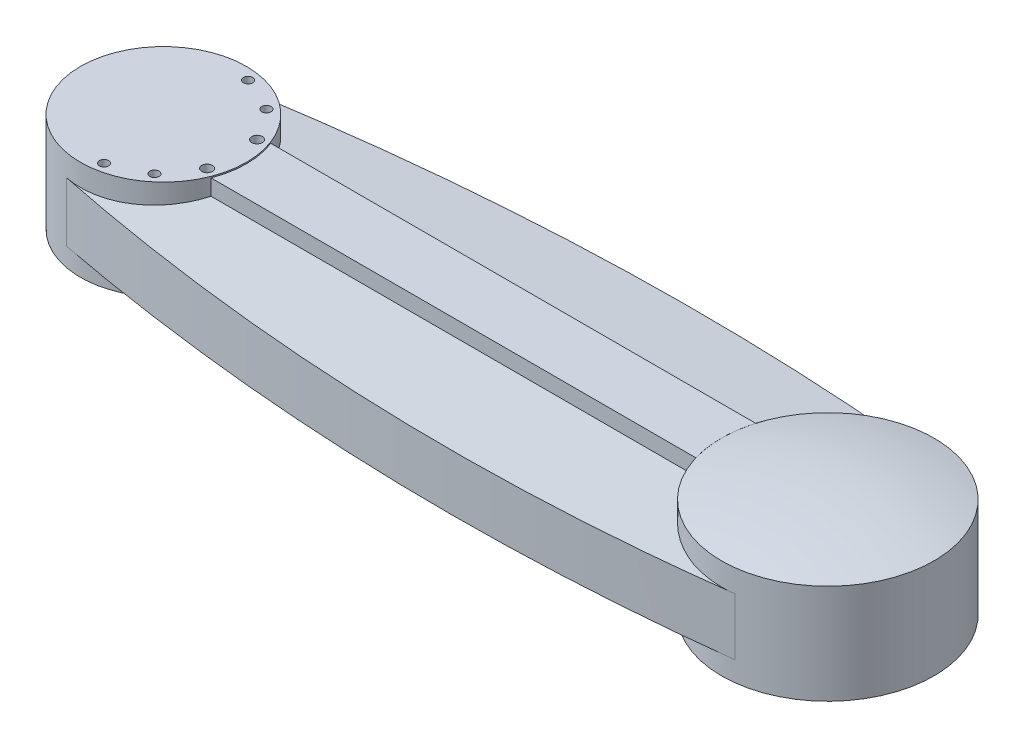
ISO-10303-21;
HEADER;
FILE_DESCRIPTION(('STEP AP214'),'2;1');
FILE_NAME('part.step','',(''),(''),'','','');
FILE_SCHEMA(('AUTOMOTIVE_DESIGN { 1 0 10303 214 1 1 1 1 }'));
ENDSEC;
DATA;
#1=APPLICATION_CONTEXT('core data for automotive mechanical design processes');
#2=APPLICATION_PROTOCOL_DEFINITION('international standard','automotive_design',2000,#1);
#3=PRODUCT_CONTEXT('',#1,'mechanical');
#4=PRODUCT('Part','Part','',(#3));
#5=PRODUCT_RELATED_PRODUCT_CATEGORY('part','',(#4));
#6=PRODUCT_DEFINITION_FORMATION('','',#4);
#7=PRODUCT_DEFINITION_CONTEXT('part definition',#1,'design');
#8=PRODUCT_DEFINITION('design','',#6,#7);
#9=PRODUCT_DEFINITION_SHAPE('','',#8);
#10=(LENGTH_UNIT() NAMED_UNIT(*) SI_UNIT(.MILLI.,.METRE.));
#11=(NAMED_UNIT(*) PLANE_ANGLE_UNIT() SI_UNIT($,.RADIAN.));
#12=(NAMED_UNIT(*) SI_UNIT($,.STERADIAN.) SOLID_ANGLE_UNIT());
#13=UNCERTAINTY_MEASURE_WITH_UNIT(LENGTH_MEASURE(1.E-05),#10,'distance_accuracy_value','');
#14=(GEOMETRIC_REPRESENTATION_CONTEXT(3) GLOBAL_UNCERTAINTY_ASSIGNED_CONTEXT((#13)) GLOBAL_UNIT_ASSIGNED_CONTEXT((#10,
#11,#12)) REPRESENTATION_CONTEXT('',''));
#15=CARTESIAN_POINT('',(0.,0.,0.));
#16=DIRECTION('',(0.,0.,1.));
#17=DIRECTION('',(1.,0.,0.));
#18=AXIS2_PLACEMENT_3D('',#15,#16,#17);
#19=CARTESIAN_POINT('',(-346.496875,55.,-804.231529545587));
#20=DIRECTION('',(0.,-1.,0.));
#21=DIRECTION('',(0.,0.,-1.));
#22=AXIS2_PLACEMENT_3D('',#19,#20,#21);
#23=PLANE('',#22);
#24=CARTESIAN_POINT('',(-281.247736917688,55.,3.12823477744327));
#25=DIRECTION('',(0.,-1.,0.));
#26=DIRECTION('',(0.,0.,-1.));
#27=AXIS2_PLACEMENT_3D('',#24,#25,#26);
#28=CIRCLE('',#27,2.99999999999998);
#29=CARTESIAN_POINT('',(-282.099964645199,55.,0.251829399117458));
#30=VERTEX_POINT('',#29);
#31=CARTESIAN_POINT('',(-280.399671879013,55.,0.250599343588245));
#32=VERTEX_POINT('',#31);
#33=EDGE_CURVE('E261',#30,#32,#28,.T.);
#34=ORIENTED_EDGE('',*,*,#33,.F.);
#35=DIRECTION('',(0.958801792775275,0.,-0.284075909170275));
#36=VECTOR('',#35,1.);
#37=CARTESIAN_POINT('',(-282.099964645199,55.,0.251829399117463));
#38=LINE('',#37,#36);
#39=CARTESIAN_POINT('',(-475.938790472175,55.,57.68282409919));
#40=VERTEX_POINT('',#39);
#41=EDGE_CURVE('E246',#40,#30,#38,.T.);
#42=ORIENTED_EDGE('',*,*,#41,.F.);
#43=CARTESIAN_POINT('',(-500.,55.,0.));
#44=DIRECTION('',(0.,1.,0.));
#45=DIRECTION('',(0.,0.,-1.));
#46=AXIS2_PLACEMENT_3D('',#43,#44,#45);
#47=CIRCLE('',#46,62.4999999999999);
#48=CARTESIAN_POINT('',(-475.938790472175,55.,-57.6828240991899));
#49=VERTEX_POINT('',#48);
#50=EDGE_CURVE('E366',#40,#49,#47,.T.);
#51=ORIENTED_EDGE('',*,*,#50,.T.);
#52=DIRECTION('',(-0.958801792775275,0.,-0.284075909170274));
#53=VECTOR('',#52,1.);
#54=CARTESIAN_POINT('',(-475.938790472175,55.,-57.6828240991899));
#55=LINE('',#54,#53);
#56=CARTESIAN_POINT('',(-282.099964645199,55.,-0.25182939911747));
#57=VERTEX_POINT('',#56);
#58=EDGE_CURVE('E290',#57,#49,#55,.T.);
#59=ORIENTED_EDGE('',*,*,#58,.F.);
#60=CARTESIAN_POINT('',(-281.247736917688,55.,-3.12823477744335));
#61=DIRECTION('',(0.,-1.,0.));
#62=DIRECTION('',(0.,0.,-1.));
#63=AXIS2_PLACEMENT_3D('',#60,#61,#62);
#64=CIRCLE('',#63,2.99999999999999);
#65=CARTESIAN_POINT('',(-280.399671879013,55.,-0.250599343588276));
#66=VERTEX_POINT('',#65);
#67=EDGE_CURVE('E298',#66,#57,#64,.T.);
#68=ORIENTED_EDGE('',*,*,#67,.F.);
#69=DIRECTION('',(-0.95921181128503,0.,0.282688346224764));
#70=VECTOR('',#69,1.);
#71=CARTESIAN_POINT('',(-280.399671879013,55.,-0.250599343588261));
#72=LINE('',#71,#70);
#73=CARTESIAN_POINT('',(-30.9892547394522,55.,-73.7540920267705));
#74=VERTEX_POINT('',#73);
#75=EDGE_CURVE('E278',#74,#66,#72,.T.);
#76=ORIENTED_EDGE('',*,*,#75,.F.);
#77=CARTESIAN_POINT('',(0.,55.,0.));
#78=DIRECTION('',(0.,1.,0.));
#79=DIRECTION('',(0.,0.,-1.));
#80=AXIS2_PLACEMENT_3D('',#77,#78,#79);
#81=CIRCLE('',#80,79.9999999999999);
#82=CARTESIAN_POINT('',(-30.9892547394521,55.,73.7540920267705));
#83=VERTEX_POINT('',#82);
#84=EDGE_CURVE('E1042',#74,#83,#81,.T.);
#85=ORIENTED_EDGE('',*,*,#84,.T.);
#86=DIRECTION('',(0.95921181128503,0.,0.282688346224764));
#87=VECTOR('',#86,1.);
#88=CARTESIAN_POINT('',(-30.9892547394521,55.,73.7540920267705));
#89=LINE('',#88,#87);
#90=EDGE_CURVE('E264',#32,#83,#89,.T.);
#91=ORIENTED_EDGE('',*,*,#90,.F.);
#92=EDGE_LOOP('',(#34,#42,#51,#59,#68,#76,#85,#91));
#93=FACE_BOUND('',#92,.T.);
#94=ADVANCED_FACE('F33',(#93),#23,.T.);
#95=CARTESIAN_POINT('',(0.,75.,0.));
#96=DIRECTION('',(0.,1.,0.));
#97=DIRECTION('',(0.,0.,1.));
#98=AXIS2_PLACEMENT_3D('',#95,#96,#97);
#99=PLANE('',#98);
#100=DIRECTION('',(1.,0.,0.));
#101=VECTOR('',#100,1.);
#102=CARTESIAN_POINT('',(-76.7707626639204,75.,22.5));
#103=LINE('',#102,#101);
#104=CARTESIAN_POINT('',(-441.690481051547,75.,22.5));
#105=VERTEX_POINT('',#104);
#106=CARTESIAN_POINT('',(-76.7707626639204,75.,22.5));
#107=VERTEX_POINT('',#106);
#108=EDGE_CURVE('E379',#105,#107,#103,.T.);
#109=ORIENTED_EDGE('',*,*,#108,.T.);
#110=CARTESIAN_POINT('',(0.,75.,0.));
#111=DIRECTION('',(0.,1.,0.));
#112=DIRECTION('',(0.,0.,1.));
#113=AXIS2_PLACEMENT_3D('',#110,#111,#112);
#114=CIRCLE('',#113,80.);
#115=CARTESIAN_POINT('',(-76.7707626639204,75.,-22.5));
#116=VERTEX_POINT('',#115);
#117=EDGE_CURVE('E306',#116,#107,#114,.T.);
#118=ORIENTED_EDGE('',*,*,#117,.F.);
#119=DIRECTION('',(-1.,0.,0.));
#120=VECTOR('',#119,1.);
#121=CARTESIAN_POINT('',(-76.7707626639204,75.,-22.5));
#122=LINE('',#121,#120);
#123=CARTESIAN_POINT('',(-441.690481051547,75.,-22.5));
#124=VERTEX_POINT('',#123);
#125=EDGE_CURVE('E382',#116,#124,#122,.T.);
#126=ORIENTED_EDGE('',*,*,#125,.T.);
#127=CARTESIAN_POINT('',(-500.,75.,0.));
#128=DIRECTION('',(0.,1.,0.));
#129=DIRECTION('',(0.,0.,1.));
#130=AXIS2_PLACEMENT_3D('',#127,#128,#129);
#131=CIRCLE('',#130,62.5);
#132=EDGE_CURVE('E356',#105,#124,#131,.T.);
#133=ORIENTED_EDGE('',*,*,#132,.F.);
#134=EDGE_LOOP('',(#109,#118,#126,#133));
#135=FACE_BOUND('',#134,.T.);
#136=ADVANCED_FACE('F493',(#135),#99,.T.);
#137=CARTESIAN_POINT('',(-500.,75.,0.));
#138=DIRECTION('',(0.,-1.,0.));
#139=DIRECTION('',(0.,0.,-1.));
#140=AXIS2_PLACEMENT_3D('',#137,#138,#139);
#141=CYLINDRICAL_SURFACE('',#140,62.5);
#142=CARTESIAN_POINT('',(-500.,76.,0.));
#143=DIRECTION('',(0.,1.,0.));
#144=DIRECTION('',(0.,0.,1.));
#145=AXIS2_PLACEMENT_3D('',#142,#143,#144);
#146=CIRCLE('',#145,62.5);
#147=CARTESIAN_POINT('',(-500.,76.,62.5000000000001));
#148=VERTEX_POINT('',#147);
#149=EDGE_CURVE('E359',#148,#148,#146,.T.);
#150=ORIENTED_EDGE('',*,*,#149,.F.);
#151=EDGE_LOOP('',(#150));
#152=FACE_BOUND('',#151,.T.);
#153=DIRECTION('',(0.,-1.,0.));
#154=VECTOR('',#153,1.);
#155=CARTESIAN_POINT('',(-441.690481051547,442.683832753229,-22.5));
#156=LINE('',#155,#154);
#157=CARTESIAN_POINT('',(-441.690481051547,63.0315050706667,-22.5));
#158=VERTEX_POINT('',#157);
#159=EDGE_CURVE('E376',#124,#158,#156,.T.);
#160=ORIENTED_EDGE('',*,*,#159,.T.);
#161=CARTESIAN_POINT('',(-500.,65.,0.));
#162=DIRECTION('',(0.,0.996194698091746,-0.0871557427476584));
#163=DIRECTION('',(0.,-0.0871557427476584,-0.996194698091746));
#164=AXIS2_PLACEMENT_3D('',#161,#162,#163);
#165=ELLIPSE('',#164,62.7387398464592,62.5);
#166=CARTESIAN_POINT('',(-511.717795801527,59.6289204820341,-61.3917198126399));
#167=VERTEX_POINT('',#166);
#168=EDGE_CURVE('E966',#167,#158,#165,.F.);
#169=ORIENTED_EDGE('',*,*,#168,.F.);
#170=DIRECTION('',(0.,-1.,0.));
#171=VECTOR('',#170,1.);
#172=CARTESIAN_POINT('',(-511.717795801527,65.,-61.3917198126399));
#173=LINE('',#172,#171);
#174=CARTESIAN_POINT('',(-511.717795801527,15.,-61.3917198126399));
#175=VERTEX_POINT('',#174);
#176=EDGE_CURVE('E985',#167,#175,#173,.T.);
#177=ORIENTED_EDGE('',*,*,#176,.T.);
#178=CARTESIAN_POINT('',(-500.,15.,0.));
#179=DIRECTION('',(0.,-1.,0.));
#180=DIRECTION('',(0.,0.,1.));
#181=AXIS2_PLACEMENT_3D('',#178,#179,#180);
#182=CIRCLE('',#181,62.5);
#183=CARTESIAN_POINT('',(-475.938790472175,15.,-57.6828240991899));
#184=VERTEX_POINT('',#183);
#185=EDGE_CURVE('E1016',#175,#184,#182,.T.);
#186=ORIENTED_EDGE('',*,*,#185,.T.);
#187=DIRECTION('',(0.,-1.,0.));
#188=VECTOR('',#187,1.);
#189=CARTESIAN_POINT('',(-475.938790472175,55.,-57.68282409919));
#190=LINE('',#189,#188);
#191=CARTESIAN_POINT('',(-475.938790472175,30.,-57.6828240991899));
#192=VERTEX_POINT('',#191);
#193=EDGE_CURVE('E1027',#192,#184,#190,.T.);
#194=ORIENTED_EDGE('',*,*,#193,.F.);
#195=EDGE_CURVE('E1023',#49,#192,#190,.T.);
#196=ORIENTED_EDGE('',*,*,#195,.F.);
#197=ORIENTED_EDGE('',*,*,#50,.F.);
#198=DIRECTION('',(0.,-1.,0.));
#199=VECTOR('',#198,1.);
#200=CARTESIAN_POINT('',(-475.938790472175,55.,57.68282409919));
#201=LINE('',#200,#199);
#202=CARTESIAN_POINT('',(-475.938790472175,30.,57.68282409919));
#203=VERTEX_POINT('',#202);
#204=EDGE_CURVE('E1022',#40,#203,#201,.T.);
#205=ORIENTED_EDGE('',*,*,#204,.T.);
#206=CARTESIAN_POINT('',(-475.938790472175,15.,57.68282409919));
#207=VERTEX_POINT('',#206);
#208=EDGE_CURVE('E1035',#203,#207,#201,.T.);
#209=ORIENTED_EDGE('',*,*,#208,.T.);
#210=CARTESIAN_POINT('',(-511.717795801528,15.,61.3917198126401));
#211=VERTEX_POINT('',#210);
#212=EDGE_CURVE('E386',#207,#211,#182,.T.);
#213=ORIENTED_EDGE('',*,*,#212,.T.);
#214=DIRECTION('',(0.,-1.,0.));
#215=VECTOR('',#214,1.);
#216=CARTESIAN_POINT('',(-511.717795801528,65.,61.3917198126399));
#217=LINE('',#216,#215);
#218=CARTESIAN_POINT('',(-511.717795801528,59.6289204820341,61.3917198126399));
#219=VERTEX_POINT('',#218);
#220=EDGE_CURVE('E1000',#219,#211,#217,.T.);
#221=ORIENTED_EDGE('',*,*,#220,.F.);
#222=CARTESIAN_POINT('',(-500.,65.,0.));
#223=DIRECTION('',(0.,0.996194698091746,0.0871557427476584));
#224=DIRECTION('',(0.,-0.0871557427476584,0.996194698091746));
#225=AXIS2_PLACEMENT_3D('',#222,#223,#224);
#226=ELLIPSE('',#225,62.7387398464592,62.5);
#227=CARTESIAN_POINT('',(-441.690481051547,63.0315050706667,22.5));
#228=VERTEX_POINT('',#227);
#229=EDGE_CURVE('E974',#228,#219,#226,.F.);
#230=ORIENTED_EDGE('',*,*,#229,.F.);
#231=DIRECTION('',(0.,-1.,0.));
#232=VECTOR('',#231,1.);
#233=CARTESIAN_POINT('',(-441.690481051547,442.683832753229,22.5));
#234=LINE('',#233,#232);
#235=EDGE_CURVE('E373',#105,#228,#234,.T.);
#236=ORIENTED_EDGE('',*,*,#235,.F.);
#237=ORIENTED_EDGE('',*,*,#132,.T.);
#238=EDGE_LOOP('',(#160,#169,#177,#186,#194,#196,#197,#205,#209,#213,#221,#230,#236,#237));
#239=FACE_BOUND('',#238,.T.);
#240=CARTESIAN_POINT('',(-500.,1.,0.));
#241=DIRECTION('',(0.,-1.,0.));
#242=DIRECTION('',(0.,0.,-1.));
#243=AXIS2_PLACEMENT_3D('',#240,#241,#242);
#244=CIRCLE('',#243,62.5);
#245=CARTESIAN_POINT('',(-500.,1.,-62.5));
#246=VERTEX_POINT('',#245);
#247=EDGE_CURVE('E310',#246,#246,#244,.T.);
#248=ORIENTED_EDGE('',*,*,#247,.F.);
#249=EDGE_LOOP('',(#248));
#250=FACE_BOUND('',#249,.T.);
#251=ADVANCED_FACE('F500',(#152,#239,#250),#141,.T.);
#252=CARTESIAN_POINT('',(-346.496875,15.,804.231529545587));
#253=DIRECTION('',(0.,1.,0.));
#254=DIRECTION('',(0.,0.,1.));
#255=AXIS2_PLACEMENT_3D('',#252,#253,#254);
#256=PLANE('',#255);
#257=ORIENTED_EDGE('',*,*,#212,.F.);
#258=CARTESIAN_POINT('',(-192.99375,15.,-1608.46305909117));
#259=DIRECTION('',(0.,-1.,0.));
#260=DIRECTION('',(0.,0.,-1.));
#261=AXIS2_PLACEMENT_3D('',#258,#259,#260);
#262=CIRCLE('',#261,1690.);
#263=CARTESIAN_POINT('',(-30.9892547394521,15.,73.7540920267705));
#264=VERTEX_POINT('',#263);
#265=EDGE_CURVE('E1038',#264,#207,#262,.T.);
#266=ORIENTED_EDGE('',*,*,#265,.F.);
#267=CARTESIAN_POINT('',(0.,15.,0.));
#268=DIRECTION('',(0.,-1.,0.));
#269=DIRECTION('',(0.,0.,1.));
#270=AXIS2_PLACEMENT_3D('',#267,#268,#269);
#271=CIRCLE('',#270,79.9999999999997);
#272=CARTESIAN_POINT('',(9.53055555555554,15.,79.4302745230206));
#273=VERTEX_POINT('',#272);
#274=EDGE_CURVE('E1011',#273,#264,#271,.T.);
#275=ORIENTED_EDGE('',*,*,#274,.F.);
#276=CARTESIAN_POINT('',(-192.99375,15.,-1608.46305909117));
#277=DIRECTION('',(0.,1.,0.));
#278=DIRECTION('',(0.,0.,1.));
#279=AXIS2_PLACEMENT_3D('',#276,#277,#278);
#280=CIRCLE('',#279,1700.);
#281=EDGE_CURVE('E1014',#211,#273,#280,.T.);
#282=ORIENTED_EDGE('',*,*,#281,.F.);
#283=EDGE_LOOP('',(#257,#266,#275,#282));
#284=FACE_BOUND('',#283,.T.);
#285=ADVANCED_FACE('F719',(#284),#256,.F.);
#286=CARTESIAN_POINT('',(0.,75.,0.));
#287=DIRECTION('',(0.,-1.,0.));
#288=DIRECTION('',(0.,0.,-1.));
#289=AXIS2_PLACEMENT_3D('',#286,#287,#288);
#290=CYLINDRICAL_SURFACE('',#289,80.);
#291=CARTESIAN_POINT('',(0.,0.,0.));
#292=DIRECTION('',(0.,1.,0.));
#293=DIRECTION('',(0.,0.,1.));
#294=AXIS2_PLACEMENT_3D('',#291,#292,#293);
#295=CIRCLE('',#294,80.);
#296=CARTESIAN_POINT('',(0.,0.,80.));
#297=VERTEX_POINT('',#296);
#298=EDGE_CURVE('E404',#297,#297,#295,.T.);
#299=ORIENTED_EDGE('',*,*,#298,.T.);
#300=EDGE_LOOP('',(#299));
#301=FACE_BOUND('',#300,.T.);
#302=DIRECTION('',(0.,-1.,0.));
#303=VECTOR('',#302,1.);
#304=CARTESIAN_POINT('',(-76.7707626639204,442.683832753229,-22.5));
#305=LINE('',#304,#303);
#306=CARTESIAN_POINT('',(-76.7707626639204,63.0315050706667,-22.5));
#307=VERTEX_POINT('',#306);
#308=EDGE_CURVE('E983',#116,#307,#305,.T.);
#309=ORIENTED_EDGE('',*,*,#308,.F.);
#310=ORIENTED_EDGE('',*,*,#117,.T.);
#311=DIRECTION('',(0.,-1.,0.));
#312=VECTOR('',#311,1.);
#313=CARTESIAN_POINT('',(-76.7707626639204,442.683832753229,22.5));
#314=LINE('',#313,#312);
#315=CARTESIAN_POINT('',(-76.7707626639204,63.0315050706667,22.5));
#316=VERTEX_POINT('',#315);
#317=EDGE_CURVE('E992',#107,#316,#314,.T.);
#318=ORIENTED_EDGE('',*,*,#317,.T.);
#319=CARTESIAN_POINT('',(0.,65.,0.));
#320=DIRECTION('',(0.,0.996194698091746,0.0871557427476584));
#321=DIRECTION('',(0.,-0.0871557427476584,0.996194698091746));
#322=AXIS2_PLACEMENT_3D('',#319,#320,#321);
#323=ELLIPSE('',#322,80.3055870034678,80.);
#324=CARTESIAN_POINT('',(9.53055555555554,58.0507514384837,79.4302745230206));
#325=VERTEX_POINT('',#324);
#326=EDGE_CURVE('E986',#325,#316,#323,.F.);
#327=ORIENTED_EDGE('',*,*,#326,.F.);
#328=DIRECTION('',(0.,-1.,0.));
#329=VECTOR('',#328,1.);
#330=CARTESIAN_POINT('',(9.53055555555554,65.,79.4302745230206));
#331=LINE('',#330,#329);
#332=EDGE_CURVE('E998',#325,#273,#331,.T.);
#333=ORIENTED_EDGE('',*,*,#332,.T.);
#334=ORIENTED_EDGE('',*,*,#274,.T.);
#335=DIRECTION('',(0.,-1.,0.));
#336=VECTOR('',#335,1.);
#337=CARTESIAN_POINT('',(-30.9892547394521,55.,73.7540920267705));
#338=LINE('',#337,#336);
#339=CARTESIAN_POINT('',(-30.9892547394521,30.,73.7540920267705));
#340=VERTEX_POINT('',#339);
#341=EDGE_CURVE('E1031',#340,#264,#338,.T.);
#342=ORIENTED_EDGE('',*,*,#341,.F.);
#343=EDGE_CURVE('E1032',#83,#340,#338,.T.);
#344=ORIENTED_EDGE('',*,*,#343,.F.);
#345=ORIENTED_EDGE('',*,*,#84,.F.);
#346=DIRECTION('',(0.,-1.,0.));
#347=VECTOR('',#346,1.);
#348=CARTESIAN_POINT('',(-30.9892547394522,55.,-73.7540920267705));
#349=LINE('',#348,#347);
#350=CARTESIAN_POINT('',(-30.9892547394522,30.,-73.7540920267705));
#351=VERTEX_POINT('',#350);
#352=EDGE_CURVE('E1028',#74,#351,#349,.T.);
#353=ORIENTED_EDGE('',*,*,#352,.T.);
#354=CARTESIAN_POINT('',(-30.9892547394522,15.,-73.7540920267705));
#355=VERTEX_POINT('',#354);
#356=EDGE_CURVE('E1026',#351,#355,#349,.T.);
#357=ORIENTED_EDGE('',*,*,#356,.T.);
#358=CARTESIAN_POINT('',(9.53055555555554,15.,-79.4302745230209));
#359=VERTEX_POINT('',#358);
#360=EDGE_CURVE('E1013',#355,#359,#271,.T.);
#361=ORIENTED_EDGE('',*,*,#360,.T.);
#362=DIRECTION('',(0.,-1.,0.));
#363=VECTOR('',#362,1.);
#364=CARTESIAN_POINT('',(9.5305555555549,65.,-79.4302745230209));
#365=LINE('',#364,#363);
#366=CARTESIAN_POINT('',(9.5305555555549,58.0507514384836,-79.4302745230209));
#367=VERTEX_POINT('',#366);
#368=EDGE_CURVE('E996',#367,#359,#365,.T.);
#369=ORIENTED_EDGE('',*,*,#368,.F.);
#370=CARTESIAN_POINT('',(0.,65.,0.));
#371=DIRECTION('',(0.,0.996194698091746,-0.0871557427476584));
#372=DIRECTION('',(0.,-0.0871557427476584,-0.996194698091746));
#373=AXIS2_PLACEMENT_3D('',#370,#371,#372);
#374=ELLIPSE('',#373,80.3055870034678,80.);
#375=EDGE_CURVE('E977',#307,#367,#374,.F.);
#376=ORIENTED_EDGE('',*,*,#375,.F.);
#377=EDGE_LOOP('',(#309,#310,#318,#327,#333,#334,#342,#344,#345,#353,#357,#361,#369,#376));
#378=FACE_BOUND('',#377,.T.);
#379=CARTESIAN_POINT('',(0.,75.0001,0.));
#380=DIRECTION('',(0.,1.,0.));
#381=DIRECTION('',(0.,0.,1.));
#382=AXIS2_PLACEMENT_3D('',#379,#380,#381);
#383=CIRCLE('',#382,80.);
#384=CARTESIAN_POINT('',(0.,75.0001,80.));
#385=VERTEX_POINT('',#384);
#386=EDGE_CURVE('E309',#385,#385,#383,.T.);
#387=ORIENTED_EDGE('',*,*,#386,.F.);
#388=EDGE_LOOP('',(#387));
#389=FACE_BOUND('',#388,.T.);
#390=ADVANCED_FACE('F711',(#301,#378,#389),#290,.T.);
#391=CARTESIAN_POINT('',(0.,65.,0.));
#392=DIRECTION('',(0.,0.996194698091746,-0.0871557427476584));
#393=DIRECTION('',(0.,0.0871557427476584,0.996194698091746));
#394=AXIS2_PLACEMENT_3D('',#391,#392,#393);
#395=PLANE('',#394);
#396=ORIENTED_EDGE('',*,*,#168,.T.);
#397=DIRECTION('',(-1.,0.,0.));
#398=VECTOR('',#397,1.);
#399=CARTESIAN_POINT('',(-76.7707626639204,63.0315050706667,-22.5));
#400=LINE('',#399,#398);
#401=EDGE_CURVE('E371',#307,#158,#400,.T.);
#402=ORIENTED_EDGE('',*,*,#401,.F.);
#403=ORIENTED_EDGE('',*,*,#375,.T.);
#404=CARTESIAN_POINT('',(-192.99375,205.722283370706,1608.46305909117));
#405=DIRECTION('',(0.,0.996194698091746,-0.0871557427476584));
#406=DIRECTION('',(0.,-0.0871557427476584,-0.996194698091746));
#407=AXIS2_PLACEMENT_3D('',#404,#405,#406);
#408=ELLIPSE('',#407,1706.49372382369,1700.);
#409=EDGE_CURVE('E969',#367,#167,#408,.T.);
#410=ORIENTED_EDGE('',*,*,#409,.T.);
#411=EDGE_LOOP('',(#396,#402,#403,#410));
#412=FACE_BOUND('',#411,.T.);
#413=ADVANCED_FACE('F718',(#412),#395,.T.);
#414=CARTESIAN_POINT('',(0.,65.,0.));
#415=DIRECTION('',(0.,0.996194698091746,0.0871557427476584));
#416=DIRECTION('',(0.,-0.0871557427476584,0.996194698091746));
#417=AXIS2_PLACEMENT_3D('',#414,#415,#416);
#418=PLANE('',#417);
#419=ORIENTED_EDGE('',*,*,#326,.T.);
#420=DIRECTION('',(1.,0.,0.));
#421=VECTOR('',#420,1.);
#422=CARTESIAN_POINT('',(-76.7707626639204,63.0315050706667,22.5));
#423=LINE('',#422,#421);
#424=EDGE_CURVE('E375',#228,#316,#423,.T.);
#425=ORIENTED_EDGE('',*,*,#424,.F.);
#426=ORIENTED_EDGE('',*,*,#229,.T.);
#427=CARTESIAN_POINT('',(-192.99375,205.722283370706,-1608.46305909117));
#428=DIRECTION('',(0.,0.996194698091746,0.0871557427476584));
#429=DIRECTION('',(0.,-0.0871557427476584,0.996194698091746));
#430=AXIS2_PLACEMENT_3D('',#427,#428,#429);
#431=ELLIPSE('',#430,1706.49372382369,1700.);
#432=EDGE_CURVE('E973',#219,#325,#431,.T.);
#433=ORIENTED_EDGE('',*,*,#432,.T.);
#434=EDGE_LOOP('',(#419,#425,#426,#433));
#435=FACE_BOUND('',#434,.T.);
#436=ADVANCED_FACE('F954',(#435),#418,.T.);
#437=CARTESIAN_POINT('',(0.,0.,0.));
#438=DIRECTION('',(0.,1.,0.));
#439=DIRECTION('',(0.,0.,1.));
#440=AXIS2_PLACEMENT_3D('',#437,#438,#439);
#441=PLANE('',#440);
#442=ORIENTED_EDGE('',*,*,#298,.F.);
#443=EDGE_LOOP('',(#442));
#444=FACE_BOUND('',#443,.T.);
#445=ADVANCED_FACE('F950',(#444),#441,.F.);
#446=CARTESIAN_POINT('',(-192.99375,65.,-1608.46305909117));
#447=DIRECTION('',(0.,-1.,0.));
#448=DIRECTION('',(0.,0.,-1.));
#449=AXIS2_PLACEMENT_3D('',#446,#447,#448);
#450=CYLINDRICAL_SURFACE('',#449,1700.);
#451=ORIENTED_EDGE('',*,*,#281,.T.);
#452=ORIENTED_EDGE('',*,*,#332,.F.);
#453=ORIENTED_EDGE('',*,*,#432,.F.);
#454=ORIENTED_EDGE('',*,*,#220,.T.);
#455=EDGE_LOOP('',(#451,#452,#453,#454));
#456=FACE_BOUND('',#455,.T.);
#457=ADVANCED_FACE('F947',(#456),#450,.T.);
#458=CARTESIAN_POINT('',(-192.99375,65.,1608.46305909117));
#459=DIRECTION('',(0.,-1.,0.));
#460=DIRECTION('',(0.,0.,-1.));
#461=AXIS2_PLACEMENT_3D('',#458,#459,#460);
#462=CYLINDRICAL_SURFACE('',#461,1700.);
#463=CARTESIAN_POINT('',(-192.99375,15.,1608.46305909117));
#464=DIRECTION('',(0.,1.,0.));
#465=DIRECTION('',(0.,0.,-1.));
#466=AXIS2_PLACEMENT_3D('',#463,#464,#465);
#467=CIRCLE('',#466,1700.);
#468=EDGE_CURVE('E979',#359,#175,#467,.T.);
#469=ORIENTED_EDGE('',*,*,#468,.T.);
#470=ORIENTED_EDGE('',*,*,#176,.F.);
#471=ORIENTED_EDGE('',*,*,#409,.F.);
#472=ORIENTED_EDGE('',*,*,#368,.T.);
#473=EDGE_LOOP('',(#469,#470,#471,#472));
#474=FACE_BOUND('',#473,.T.);
#475=ADVANCED_FACE('F943',(#474),#462,.T.);
#476=ORIENTED_EDGE('',*,*,#360,.F.);
#477=CARTESIAN_POINT('',(-192.99375,15.,1608.46305909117));
#478=DIRECTION('',(0.,-1.,0.));
#479=DIRECTION('',(0.,0.,1.));
#480=AXIS2_PLACEMENT_3D('',#477,#478,#479);
#481=CIRCLE('',#480,1690.);
#482=EDGE_CURVE('E362',#184,#355,#481,.T.);
#483=ORIENTED_EDGE('',*,*,#482,.F.);
#484=ORIENTED_EDGE('',*,*,#185,.F.);
#485=ORIENTED_EDGE('',*,*,#468,.F.);
#486=EDGE_LOOP('',(#476,#483,#484,#485));
#487=FACE_BOUND('',#486,.T.);
#488=ADVANCED_FACE('F938',(#487),#256,.F.);
#489=CARTESIAN_POINT('',(-76.7707626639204,442.683832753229,-22.5));
#490=DIRECTION('',(0.,0.,1.));
#491=DIRECTION('',(1.,0.,0.));
#492=AXIS2_PLACEMENT_3D('',#489,#490,#491);
#493=PLANE('',#492);
#494=ORIENTED_EDGE('',*,*,#125,.F.);
#495=ORIENTED_EDGE('',*,*,#308,.T.);
#496=ORIENTED_EDGE('',*,*,#401,.T.);
#497=ORIENTED_EDGE('',*,*,#159,.F.);
#498=EDGE_LOOP('',(#494,#495,#496,#497));
#499=FACE_BOUND('',#498,.T.);
#500=ADVANCED_FACE('F749',(#499),#493,.F.);
#501=CARTESIAN_POINT('',(-76.7707626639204,442.683832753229,22.5));
#502=DIRECTION('',(0.,0.,-1.));
#503=DIRECTION('',(-1.,0.,0.));
#504=AXIS2_PLACEMENT_3D('',#501,#502,#503);
#505=PLANE('',#504);
#506=ORIENTED_EDGE('',*,*,#108,.F.);
#507=ORIENTED_EDGE('',*,*,#235,.T.);
#508=ORIENTED_EDGE('',*,*,#424,.T.);
#509=ORIENTED_EDGE('',*,*,#317,.F.);
#510=EDGE_LOOP('',(#506,#507,#508,#509));
#511=FACE_BOUND('',#510,.T.);
#512=ADVANCED_FACE('F744',(#511),#505,.F.);
#513=CARTESIAN_POINT('',(-192.99375,55.,-1608.46305909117));
#514=DIRECTION('',(0.,-1.,0.));
#515=DIRECTION('',(0.,0.,-1.));
#516=AXIS2_PLACEMENT_3D('',#513,#514,#515);
#517=CYLINDRICAL_SURFACE('',#516,1690.);
#518=ORIENTED_EDGE('',*,*,#208,.F.);
#519=CARTESIAN_POINT('',(-192.99375,30.,-1608.46305909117));
#520=DIRECTION('',(0.,-1.,0.));
#521=DIRECTION('',(0.,0.,-1.));
#522=AXIS2_PLACEMENT_3D('',#519,#520,#521);
#523=CIRCLE('',#522,1690.);
#524=EDGE_CURVE('E238',#340,#203,#523,.T.);
#525=ORIENTED_EDGE('',*,*,#524,.F.);
#526=ORIENTED_EDGE('',*,*,#341,.T.);
#527=ORIENTED_EDGE('',*,*,#265,.T.);
#528=EDGE_LOOP('',(#518,#525,#526,#527));
#529=FACE_BOUND('',#528,.T.);
#530=ADVANCED_FACE('F748',(#529),#517,.F.);
#531=CARTESIAN_POINT('',(-192.99375,55.,1608.46305909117));
#532=DIRECTION('',(0.,-1.,0.));
#533=DIRECTION('',(0.,0.,-1.));
#534=AXIS2_PLACEMENT_3D('',#531,#532,#533);
#535=CYLINDRICAL_SURFACE('',#534,1690.);
#536=ORIENTED_EDGE('',*,*,#356,.F.);
#537=CARTESIAN_POINT('',(-192.99375,30.,1608.46305909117));
#538=DIRECTION('',(0.,-1.,0.));
#539=DIRECTION('',(0.,0.,-1.));
#540=AXIS2_PLACEMENT_3D('',#537,#538,#539);
#541=CIRCLE('',#540,1690.);
#542=EDGE_CURVE('E286',#192,#351,#541,.T.);
#543=ORIENTED_EDGE('',*,*,#542,.F.);
#544=ORIENTED_EDGE('',*,*,#193,.T.);
#545=ORIENTED_EDGE('',*,*,#482,.T.);
#546=EDGE_LOOP('',(#536,#543,#544,#545));
#547=FACE_BOUND('',#546,.T.);
#548=ADVANCED_FACE('F764',(#547),#535,.F.);
#549=CARTESIAN_POINT('',(-500.,76.,0.));
#550=DIRECTION('',(0.,1.,0.));
#551=DIRECTION('',(0.,0.,1.));
#552=AXIS2_PLACEMENT_3D('',#549,#550,#551);
#553=PLANE('',#552);
#554=CARTESIAN_POINT('',(-448.316905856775,76.,18.8111078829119));
#555=DIRECTION('',(0.,1.,0.));
#556=DIRECTION('',(0.,0.,1.));
#557=AXIS2_PLACEMENT_3D('',#554,#555,#556);
#558=CIRCLE('',#557,3.99999999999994);
#559=CARTESIAN_POINT('',(-448.316905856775,76.,22.8111078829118));
#560=VERTEX_POINT('',#559);
#561=EDGE_CURVE('E318',#560,#560,#558,.T.);
#562=ORIENTED_EDGE('',*,*,#561,.F.);
#563=EDGE_LOOP('',(#562));
#564=FACE_BOUND('',#563,.T.);
#565=CARTESIAN_POINT('',(-448.316905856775,76.,-18.8111078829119));
#566=DIRECTION('',(0.,1.,0.));
#567=DIRECTION('',(0.,0.,1.));
#568=AXIS2_PLACEMENT_3D('',#565,#566,#567);
#569=CIRCLE('',#568,3.99999999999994);
#570=CARTESIAN_POINT('',(-448.316905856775,76.,-14.8111078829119));
#571=VERTEX_POINT('',#570);
#572=EDGE_CURVE('E325',#571,#571,#569,.T.);
#573=ORIENTED_EDGE('',*,*,#572,.F.);
#574=EDGE_LOOP('',(#573));
#575=FACE_BOUND('',#574,.T.);
#576=CARTESIAN_POINT('',(-490.449350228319,76.,54.1644264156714));
#577=DIRECTION('',(0.,1.,0.));
#578=DIRECTION('',(0.,0.,1.));
#579=AXIS2_PLACEMENT_3D('',#576,#577,#578);
#580=CIRCLE('',#579,3.50000000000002);
#581=CARTESIAN_POINT('',(-490.449350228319,76.,57.6644264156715));
#582=VERTEX_POINT('',#581);
#583=EDGE_CURVE('E331',#582,#582,#580,.T.);
#584=ORIENTED_EDGE('',*,*,#583,.F.);
#585=EDGE_LOOP('',(#584));
#586=FACE_BOUND('',#585,.T.);
#587=CARTESIAN_POINT('',(-464.64668146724,76.,42.1324443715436));
#588=DIRECTION('',(0.,1.,0.));
#589=DIRECTION('',(0.,0.,1.));
#590=AXIS2_PLACEMENT_3D('',#587,#588,#589);
#591=CIRCLE('',#590,3.50000000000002);
#592=CARTESIAN_POINT('',(-464.64668146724,76.,45.6324443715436));
#593=VERTEX_POINT('',#592);
#594=EDGE_CURVE('E335',#593,#593,#591,.T.);
#595=ORIENTED_EDGE('',*,*,#594,.F.);
#596=EDGE_LOOP('',(#595));
#597=FACE_BOUND('',#596,.T.);
#598=CARTESIAN_POINT('',(-464.64668146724,76.,-42.1324443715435));
#599=DIRECTION('',(0.,1.,0.));
#600=DIRECTION('',(0.,0.,1.));
#601=AXIS2_PLACEMENT_3D('',#598,#599,#600);
#602=CIRCLE('',#601,3.50000000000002);
#603=CARTESIAN_POINT('',(-464.64668146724,76.,-38.6324443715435));
#604=VERTEX_POINT('',#603);
#605=EDGE_CURVE('E346',#604,#604,#602,.T.);
#606=ORIENTED_EDGE('',*,*,#605,.F.);
#607=EDGE_LOOP('',(#606));
#608=FACE_BOUND('',#607,.T.);
#609=CARTESIAN_POINT('',(-490.449350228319,76.,-54.1644264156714));
#610=DIRECTION('',(0.,1.,0.));
#611=DIRECTION('',(0.,0.,1.));
#612=AXIS2_PLACEMENT_3D('',#609,#610,#611);
#613=CIRCLE('',#612,3.50000000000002);
#614=CARTESIAN_POINT('',(-490.449350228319,76.,-50.6644264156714));
#615=VERTEX_POINT('',#614);
#616=EDGE_CURVE('E350',#615,#615,#613,.T.);
#617=ORIENTED_EDGE('',*,*,#616,.F.);
#618=EDGE_LOOP('',(#617));
#619=FACE_BOUND('',#618,.T.);
#620=ORIENTED_EDGE('',*,*,#149,.T.);
#621=EDGE_LOOP('',(#620));
#622=FACE_BOUND('',#621,.T.);
#623=ADVANCED_FACE('F769',(#564,#575,#586,#597,#608,#619,#622),#553,.T.);
#624=CARTESIAN_POINT('',(-490.449350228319,64.,-54.1644264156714));
#625=DIRECTION('',(0.,1.,0.));
#626=DIRECTION('',(0.,0.,1.));
#627=AXIS2_PLACEMENT_3D('',#624,#625,#626);
#628=CYLINDRICAL_SURFACE('',#627,3.50000000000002);
#629=CARTESIAN_POINT('',(-490.449350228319,64.,-54.1644264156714));
#630=DIRECTION('',(0.,1.,0.));
#631=DIRECTION('',(0.,0.,1.));
#632=AXIS2_PLACEMENT_3D('',#629,#630,#631);
#633=CIRCLE('',#632,3.50000000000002);
#634=CARTESIAN_POINT('',(-490.449350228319,64.,-50.6644264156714));
#635=VERTEX_POINT('',#634);
#636=EDGE_CURVE('E353',#635,#635,#633,.T.);
#637=ORIENTED_EDGE('',*,*,#636,.F.);
#638=EDGE_LOOP('',(#637));
#639=FACE_BOUND('',#638,.T.);
#640=ORIENTED_EDGE('',*,*,#616,.T.);
#641=EDGE_LOOP('',(#640));
#642=FACE_BOUND('',#641,.T.);
#643=ADVANCED_FACE('F777',(#639,#642),#628,.F.);
#644=CARTESIAN_POINT('',(-490.449350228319,64.,-54.1644264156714));
#645=DIRECTION('',(0.,1.,0.));
#646=DIRECTION('',(0.,0.,1.));
#647=AXIS2_PLACEMENT_3D('',#644,#645,#646);
#648=PLANE('',#647);
#649=ORIENTED_EDGE('',*,*,#636,.T.);
#650=EDGE_LOOP('',(#649));
#651=FACE_BOUND('',#650,.T.);
#652=ADVANCED_FACE('F786',(#651),#648,.T.);
#653=CARTESIAN_POINT('',(-464.64668146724,64.,-42.1324443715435));
#654=DIRECTION('',(0.,1.,0.));
#655=DIRECTION('',(0.,0.,1.));
#656=AXIS2_PLACEMENT_3D('',#653,#654,#655);
#657=CYLINDRICAL_SURFACE('',#656,3.50000000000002);
#658=CARTESIAN_POINT('',(-464.64668146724,64.,-42.1324443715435));
#659=DIRECTION('',(0.,1.,0.));
#660=DIRECTION('',(0.,0.,1.));
#661=AXIS2_PLACEMENT_3D('',#658,#659,#660);
#662=CIRCLE('',#661,3.50000000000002);
#663=CARTESIAN_POINT('',(-464.64668146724,64.,-38.6324443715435));
#664=VERTEX_POINT('',#663);
#665=EDGE_CURVE('E347',#664,#664,#662,.T.);
#666=ORIENTED_EDGE('',*,*,#665,.F.);
#667=EDGE_LOOP('',(#666));
#668=FACE_BOUND('',#667,.T.);
#669=ORIENTED_EDGE('',*,*,#605,.T.);
#670=EDGE_LOOP('',(#669));
#671=FACE_BOUND('',#670,.T.);
#672=ADVANCED_FACE('F794',(#668,#671),#657,.F.);
#673=CARTESIAN_POINT('',(-464.64668146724,64.,-42.1324443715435));
#674=DIRECTION('',(0.,1.,0.));
#675=DIRECTION('',(0.,0.,1.));
#676=AXIS2_PLACEMENT_3D('',#673,#674,#675);
#677=PLANE('',#676);
#678=ORIENTED_EDGE('',*,*,#665,.T.);
#679=EDGE_LOOP('',(#678));
#680=FACE_BOUND('',#679,.T.);
#681=ADVANCED_FACE('F802',(#680),#677,.T.);
#682=CARTESIAN_POINT('',(-464.64668146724,64.,42.1324443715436));
#683=DIRECTION('',(0.,1.,0.));
#684=DIRECTION('',(0.,0.,1.));
#685=AXIS2_PLACEMENT_3D('',#682,#683,#684);
#686=CYLINDRICAL_SURFACE('',#685,3.50000000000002);
#687=CARTESIAN_POINT('',(-464.64668146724,64.,42.1324443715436));
#688=DIRECTION('',(0.,1.,0.));
#689=DIRECTION('',(0.,0.,1.));
#690=AXIS2_PLACEMENT_3D('',#687,#688,#689);
#691=CIRCLE('',#690,3.50000000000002);
#692=CARTESIAN_POINT('',(-464.64668146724,64.,45.6324443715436));
#693=VERTEX_POINT('',#692);
#694=EDGE_CURVE('E338',#693,#693,#691,.T.);
#695=ORIENTED_EDGE('',*,*,#694,.F.);
#696=EDGE_LOOP('',(#695));
#697=FACE_BOUND('',#696,.T.);
#698=ORIENTED_EDGE('',*,*,#594,.T.);
#699=EDGE_LOOP('',(#698));
#700=FACE_BOUND('',#699,.T.);
#701=ADVANCED_FACE('F810',(#697,#700),#686,.F.);
#702=CARTESIAN_POINT('',(-464.64668146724,64.,42.1324443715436));
#703=DIRECTION('',(0.,1.,0.));
#704=DIRECTION('',(0.,0.,1.));
#705=AXIS2_PLACEMENT_3D('',#702,#703,#704);
#706=PLANE('',#705);
#707=ORIENTED_EDGE('',*,*,#694,.T.);
#708=EDGE_LOOP('',(#707));
#709=FACE_BOUND('',#708,.T.);
#710=ADVANCED_FACE('F819',(#709),#706,.T.);
#711=CARTESIAN_POINT('',(-490.449350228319,64.,54.1644264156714));
#712=DIRECTION('',(0.,1.,0.));
#713=DIRECTION('',(0.,0.,1.));
#714=AXIS2_PLACEMENT_3D('',#711,#712,#713);
#715=CYLINDRICAL_SURFACE('',#714,3.50000000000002);
#716=CARTESIAN_POINT('',(-490.449350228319,64.,54.1644264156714));
#717=DIRECTION('',(0.,1.,0.));
#718=DIRECTION('',(0.,0.,1.));
#719=AXIS2_PLACEMENT_3D('',#716,#717,#718);
#720=CIRCLE('',#719,3.50000000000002);
#721=CARTESIAN_POINT('',(-490.449350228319,64.,57.6644264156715));
#722=VERTEX_POINT('',#721);
#723=EDGE_CURVE('E332',#722,#722,#720,.T.);
#724=ORIENTED_EDGE('',*,*,#723,.F.);
#725=EDGE_LOOP('',(#724));
#726=FACE_BOUND('',#725,.T.);
#727=ORIENTED_EDGE('',*,*,#583,.T.);
#728=EDGE_LOOP('',(#727));
#729=FACE_BOUND('',#728,.T.);
#730=ADVANCED_FACE('F827',(#726,#729),#715,.F.);
#731=CARTESIAN_POINT('',(-490.449350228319,64.,54.1644264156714));
#732=DIRECTION('',(0.,1.,0.));
#733=DIRECTION('',(0.,0.,1.));
#734=AXIS2_PLACEMENT_3D('',#731,#732,#733);
#735=PLANE('',#734);
#736=ORIENTED_EDGE('',*,*,#723,.T.);
#737=EDGE_LOOP('',(#736));
#738=FACE_BOUND('',#737,.T.);
#739=ADVANCED_FACE('F835',(#738),#735,.T.);
#740=CARTESIAN_POINT('',(-448.316905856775,70.,-18.8111078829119));
#741=DIRECTION('',(0.,1.,0.));
#742=DIRECTION('',(0.,0.,1.));
#743=AXIS2_PLACEMENT_3D('',#740,#741,#742);
#744=PLANE('',#743);
#745=CARTESIAN_POINT('',(-448.316905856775,70.,-18.8111078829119));
#746=DIRECTION('',(0.,1.,0.));
#747=DIRECTION('',(0.,0.,1.));
#748=AXIS2_PLACEMENT_3D('',#745,#746,#747);
#749=CIRCLE('',#748,3.99999999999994);
#750=CARTESIAN_POINT('',(-448.316905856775,70.,-14.8111078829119));
#751=VERTEX_POINT('',#750);
#752=EDGE_CURVE('E321',#751,#751,#749,.T.);
#753=ORIENTED_EDGE('',*,*,#752,.T.);
#754=EDGE_LOOP('',(#753));
#755=FACE_BOUND('',#754,.T.);
#756=CARTESIAN_POINT('',(-448.316905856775,70.,-18.8111078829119));
#757=DIRECTION('',(0.,1.,0.));
#758=DIRECTION('',(0.,0.,1.));
#759=AXIS2_PLACEMENT_3D('',#756,#757,#758);
#760=CIRCLE('',#759,3.50000000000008);
#761=CARTESIAN_POINT('',(-448.316905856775,70.,-15.3111078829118));
#762=VERTEX_POINT('',#761);
#763=EDGE_CURVE('E324',#762,#762,#760,.F.);
#764=ORIENTED_EDGE('',*,*,#763,.T.);
#765=EDGE_LOOP('',(#764));
#766=FACE_BOUND('',#765,.T.);
#767=ADVANCED_FACE('F843',(#755,#766),#744,.T.);
#768=CARTESIAN_POINT('',(-448.316905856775,70.,-18.8111078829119));
#769=DIRECTION('',(0.,1.,0.));
#770=DIRECTION('',(0.,0.,1.));
#771=AXIS2_PLACEMENT_3D('',#768,#769,#770);
#772=CYLINDRICAL_SURFACE('',#771,3.99999999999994);
#773=ORIENTED_EDGE('',*,*,#752,.F.);
#774=EDGE_LOOP('',(#773));
#775=FACE_BOUND('',#774,.T.);
#776=ORIENTED_EDGE('',*,*,#572,.T.);
#777=EDGE_LOOP('',(#776));
#778=FACE_BOUND('',#777,.T.);
#779=ADVANCED_FACE('F850',(#775,#778),#772,.F.);
#780=CARTESIAN_POINT('',(-448.316905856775,64.,-18.8111078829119));
#781=DIRECTION('',(0.,1.,0.));
#782=DIRECTION('',(0.,0.,1.));
#783=AXIS2_PLACEMENT_3D('',#780,#781,#782);
#784=PLANE('',#783);
#785=CARTESIAN_POINT('',(-448.316905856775,64.,-18.8111078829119));
#786=DIRECTION('',(0.,1.,0.));
#787=DIRECTION('',(0.,0.,1.));
#788=AXIS2_PLACEMENT_3D('',#785,#786,#787);
#789=CIRCLE('',#788,3.50000000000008);
#790=CARTESIAN_POINT('',(-448.316905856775,64.,-15.3111078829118));
#791=VERTEX_POINT('',#790);
#792=EDGE_CURVE('E341',#791,#791,#789,.T.);
#793=ORIENTED_EDGE('',*,*,#792,.T.);
#794=EDGE_LOOP('',(#793));
#795=FACE_BOUND('',#794,.T.);
#796=ADVANCED_FACE('F858',(#795),#784,.T.);
#797=CARTESIAN_POINT('',(-448.316905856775,64.,-18.8111078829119));
#798=DIRECTION('',(0.,1.,0.));
#799=DIRECTION('',(0.,0.,1.));
#800=AXIS2_PLACEMENT_3D('',#797,#798,#799);
#801=CYLINDRICAL_SURFACE('',#800,3.50000000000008);
#802=ORIENTED_EDGE('',*,*,#792,.F.);
#803=EDGE_LOOP('',(#802));
#804=FACE_BOUND('',#803,.T.);
#805=ORIENTED_EDGE('',*,*,#763,.F.);
#806=EDGE_LOOP('',(#805));
#807=FACE_BOUND('',#806,.T.);
#808=ADVANCED_FACE('F866',(#804,#807),#801,.F.);
#809=CARTESIAN_POINT('',(-448.316905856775,70.,18.8111078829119));
#810=DIRECTION('',(0.,1.,0.));
#811=DIRECTION('',(0.,0.,1.));
#812=AXIS2_PLACEMENT_3D('',#809,#810,#811);
#813=PLANE('',#812);
#814=CARTESIAN_POINT('',(-448.316905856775,70.,18.8111078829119));
#815=DIRECTION('',(0.,1.,0.));
#816=DIRECTION('',(0.,0.,1.));
#817=AXIS2_PLACEMENT_3D('',#814,#815,#816);
#818=CIRCLE('',#817,3.99999999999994);
#819=CARTESIAN_POINT('',(-448.316905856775,70.,22.8111078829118));
#820=VERTEX_POINT('',#819);
#821=EDGE_CURVE('E314',#820,#820,#818,.T.);
#822=ORIENTED_EDGE('',*,*,#821,.T.);
#823=EDGE_LOOP('',(#822));
#824=FACE_BOUND('',#823,.T.);
#825=CARTESIAN_POINT('',(-448.316905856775,70.,18.8111078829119));
#826=DIRECTION('',(0.,1.,0.));
#827=DIRECTION('',(0.,0.,1.));
#828=AXIS2_PLACEMENT_3D('',#825,#826,#827);
#829=CIRCLE('',#828,3.50000000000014);
#830=CARTESIAN_POINT('',(-448.316905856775,70.,22.311107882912));
#831=VERTEX_POINT('',#830);
#832=EDGE_CURVE('E317',#831,#831,#829,.F.);
#833=ORIENTED_EDGE('',*,*,#832,.T.);
#834=EDGE_LOOP('',(#833));
#835=FACE_BOUND('',#834,.T.);
#836=ADVANCED_FACE('F873',(#824,#835),#813,.T.);
#837=CARTESIAN_POINT('',(-448.316905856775,70.,18.8111078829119));
#838=DIRECTION('',(0.,1.,0.));
#839=DIRECTION('',(0.,0.,1.));
#840=AXIS2_PLACEMENT_3D('',#837,#838,#839);
#841=CYLINDRICAL_SURFACE('',#840,3.99999999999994);
#842=ORIENTED_EDGE('',*,*,#821,.F.);
#843=EDGE_LOOP('',(#842));
#844=FACE_BOUND('',#843,.T.);
#845=ORIENTED_EDGE('',*,*,#561,.T.);
#846=EDGE_LOOP('',(#845));
#847=FACE_BOUND('',#846,.T.);
#848=ADVANCED_FACE('F881',(#844,#847),#841,.F.);
#849=CARTESIAN_POINT('',(-448.316905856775,64.,18.8111078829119));
#850=DIRECTION('',(0.,1.,0.));
#851=DIRECTION('',(0.,0.,1.));
#852=AXIS2_PLACEMENT_3D('',#849,#850,#851);
#853=PLANE('',#852);
#854=CARTESIAN_POINT('',(-448.316905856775,64.,18.8111078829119));
#855=DIRECTION('',(0.,1.,0.));
#856=DIRECTION('',(0.,0.,1.));
#857=AXIS2_PLACEMENT_3D('',#854,#855,#856);
#858=CIRCLE('',#857,3.50000000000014);
#859=CARTESIAN_POINT('',(-448.316905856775,64.,22.311107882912));
#860=VERTEX_POINT('',#859);
#861=EDGE_CURVE('E328',#860,#860,#858,.T.);
#862=ORIENTED_EDGE('',*,*,#861,.T.);
#863=EDGE_LOOP('',(#862));
#864=FACE_BOUND('',#863,.T.);
#865=ADVANCED_FACE('F889',(#864),#853,.T.);
#866=CARTESIAN_POINT('',(-448.316905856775,64.,18.8111078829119));
#867=DIRECTION('',(0.,1.,0.));
#868=DIRECTION('',(0.,0.,1.));
#869=AXIS2_PLACEMENT_3D('',#866,#867,#868);
#870=CYLINDRICAL_SURFACE('',#869,3.50000000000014);
#871=ORIENTED_EDGE('',*,*,#861,.F.);
#872=EDGE_LOOP('',(#871));
#873=FACE_BOUND('',#872,.T.);
#874=ORIENTED_EDGE('',*,*,#832,.F.);
#875=EDGE_LOOP('',(#874));
#876=FACE_BOUND('',#875,.T.);
#877=ADVANCED_FACE('F897',(#873,#876),#870,.F.);
#878=CARTESIAN_POINT('',(-500.,1.,0.));
#879=DIRECTION('',(0.,-1.,0.));
#880=DIRECTION('',(0.,0.,-1.));
#881=AXIS2_PLACEMENT_3D('',#878,#879,#880);
#882=PLANE('',#881);
#883=ORIENTED_EDGE('',*,*,#247,.T.);
#884=EDGE_LOOP('',(#883));
#885=FACE_BOUND('',#884,.T.);
#886=CARTESIAN_POINT('',(-500.,1.,0.));
#887=DIRECTION('',(0.,-1.,0.));
#888=DIRECTION('',(0.,0.,-1.));
#889=AXIS2_PLACEMENT_3D('',#886,#887,#888);
#890=CIRCLE('',#889,55.);
#891=CARTESIAN_POINT('',(-500.,1.,-54.9999999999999));
#892=VERTEX_POINT('',#891);
#893=EDGE_CURVE('E313',#892,#892,#890,.F.);
#894=ORIENTED_EDGE('',*,*,#893,.T.);
#895=EDGE_LOOP('',(#894));
#896=FACE_BOUND('',#895,.T.);
#897=ADVANCED_FACE('F904',(#885,#896),#882,.T.);
#898=CARTESIAN_POINT('',(-500.,23.,0.));
#899=DIRECTION('',(0.,-1.,0.));
#900=DIRECTION('',(0.,0.,-1.));
#901=AXIS2_PLACEMENT_3D('',#898,#899,#900);
#902=PLANE('',#901);
#903=CARTESIAN_POINT('',(-500.,23.,0.));
#904=DIRECTION('',(0.,-1.,0.));
#905=DIRECTION('',(0.,0.,-1.));
#906=AXIS2_PLACEMENT_3D('',#903,#904,#905);
#907=CIRCLE('',#906,55.);
#908=CARTESIAN_POINT('',(-500.,23.,-54.9999999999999));
#909=VERTEX_POINT('',#908);
#910=EDGE_CURVE('E1019',#909,#909,#907,.T.);
#911=ORIENTED_EDGE('',*,*,#910,.T.);
#912=EDGE_LOOP('',(#911));
#913=FACE_BOUND('',#912,.T.);
#914=ADVANCED_FACE('F911',(#913),#902,.T.);
#915=CARTESIAN_POINT('',(-500.,23.,0.));
#916=DIRECTION('',(0.,-1.,0.));
#917=DIRECTION('',(0.,0.,-1.));
#918=AXIS2_PLACEMENT_3D('',#915,#916,#917);
#919=CYLINDRICAL_SURFACE('',#918,55.);
#920=ORIENTED_EDGE('',*,*,#910,.F.);
#921=EDGE_LOOP('',(#920));
#922=FACE_BOUND('',#921,.T.);
#923=ORIENTED_EDGE('',*,*,#893,.F.);
#924=EDGE_LOOP('',(#923));
#925=FACE_BOUND('',#924,.T.);
#926=ADVANCED_FACE('F707',(#922,#925),#919,.F.);
#927=CARTESIAN_POINT('',(0.,-239.9999,0.));
#928=DIRECTION('',(0.,0.,1.));
#929=DIRECTION('',(1.,0.,0.));
#930=AXIS2_PLACEMENT_3D('',#927,#928,#929);
#931=SPHERICAL_SURFACE('',#930,325.);
#932=CARTESIAN_POINT('',(0.,-239.9999,0.));
#933=DIRECTION('',(0.,1.,0.));
#934=DIRECTION('',(0.,0.,1.));
#935=AXIS2_PLACEMENT_3D('',#932,#933,#934);
#936=SPHERICAL_SURFACE('',#935,325.);
#937=ORIENTED_EDGE('',*,*,#386,.T.);
#938=EDGE_LOOP('',(#937));
#939=FACE_BOUND('',#938,.T.);
#940=ADVANCED_FACE('F550',(#939),#936,.T.);
#941=CARTESIAN_POINT('',(-192.99375,30.,1608.46305909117));
#942=DIRECTION('',(0.,-1.,0.));
#943=DIRECTION('',(0.,0.,-1.));
#944=AXIS2_PLACEMENT_3D('',#941,#942,#943);
#945=PLANE('',#944);
#946=ORIENTED_EDGE('',*,*,#542,.T.);
#947=DIRECTION('',(-0.95921181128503,0.,0.282688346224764));
#948=VECTOR('',#947,1.);
#949=CARTESIAN_POINT('',(-280.399671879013,30.,-0.250599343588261));
#950=LINE('',#949,#948);
#951=CARTESIAN_POINT('',(-280.399671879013,30.,-0.250599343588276));
#952=VERTEX_POINT('',#951);
#953=EDGE_CURVE('E289',#351,#952,#950,.T.);
#954=ORIENTED_EDGE('',*,*,#953,.T.);
#955=CARTESIAN_POINT('',(-281.247736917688,30.,-3.12823477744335));
#956=DIRECTION('',(0.,-1.,0.));
#957=DIRECTION('',(0.,0.,-1.));
#958=AXIS2_PLACEMENT_3D('',#955,#956,#957);
#959=CIRCLE('',#958,2.99999999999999);
#960=CARTESIAN_POINT('',(-282.099964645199,30.,-0.25182939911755));
#961=VERTEX_POINT('',#960);
#962=EDGE_CURVE('E292',#952,#961,#959,.T.);
#963=ORIENTED_EDGE('',*,*,#962,.T.);
#964=DIRECTION('',(-0.958801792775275,0.,-0.284075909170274));
#965=VECTOR('',#964,1.);
#966=CARTESIAN_POINT('',(-475.938790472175,30.,-57.6828240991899));
#967=LINE('',#966,#965);
#968=EDGE_CURVE('E294',#961,#192,#967,.T.);
#969=ORIENTED_EDGE('',*,*,#968,.T.);
#970=EDGE_LOOP('',(#946,#954,#963,#969));
#971=FACE_BOUND('',#970,.T.);
#972=DIRECTION('',(-0.95921181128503,0.,0.282688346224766));
#973=VECTOR('',#972,1.);
#974=CARTESIAN_POINT('',(-281.246228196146,30.,-5.21372462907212));
#975=LINE('',#974,#973);
#976=CARTESIAN_POINT('',(-111.918522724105,30.,-55.1161220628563));
#977=VERTEX_POINT('',#976);
#978=CARTESIAN_POINT('',(-278.411801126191,30.,-6.04905577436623));
#979=VERTEX_POINT('',#978);
#980=EDGE_CURVE('E271',#977,#979,#975,.T.);
#981=ORIENTED_EDGE('',*,*,#980,.F.);
#982=CARTESIAN_POINT('',(-114.745406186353,30.,-64.7082401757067));
#983=DIRECTION('',(0.,-1.,0.));
#984=DIRECTION('',(0.,0.,-1.));
#985=AXIS2_PLACEMENT_3D('',#982,#983,#984);
#986=CIRCLE('',#985,10.);
#987=CARTESIAN_POINT('',(-114.278251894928,30.,-74.6973225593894));
#988=VERTEX_POINT('',#987);
#989=EDGE_CURVE('E443',#977,#988,#986,.F.);
#990=ORIENTED_EDGE('',*,*,#989,.T.);
#991=CARTESIAN_POINT('',(-192.99375,30.,1608.46305909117));
#992=DIRECTION('',(0.,-1.,0.));
#993=DIRECTION('',(0.,0.,-1.));
#994=AXIS2_PLACEMENT_3D('',#991,#992,#993);
#995=CIRCLE('',#994,1685.);
#996=CARTESIAN_POINT('',(-408.058553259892,30.,-62.7556969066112));
#997=VERTEX_POINT('',#996);
#998=EDGE_CURVE('E268',#997,#988,#995,.T.);
#999=ORIENTED_EDGE('',*,*,#998,.F.);
#1000=CARTESIAN_POINT('',(-406.782204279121,30.,-52.8374847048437));
#1001=DIRECTION('',(0.,-1.,0.));
#1002=DIRECTION('',(0.,0.,-1.));
#1003=AXIS2_PLACEMENT_3D('',#1000,#1001,#1002);
#1004=CIRCLE('',#1003,10.);
#1005=CARTESIAN_POINT('',(-409.622963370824,30.,-43.2494667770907));
#1006=VERTEX_POINT('',#1005);
#1007=EDGE_CURVE('E445',#997,#1006,#1004,.F.);
#1008=ORIENTED_EDGE('',*,*,#1007,.T.);
#1009=DIRECTION('',(-0.958801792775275,0.,-0.284075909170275));
#1010=VECTOR('',#1009,1.);
#1011=CARTESIAN_POINT('',(-453.562187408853,30.,-56.2678769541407));
#1012=LINE('',#1011,#1010);
#1013=CARTESIAN_POINT('',(-284.079443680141,30.,-6.05315595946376));
#1014=VERTEX_POINT('',#1013);
#1015=EDGE_CURVE('E275',#1014,#1006,#1012,.T.);
#1016=ORIENTED_EDGE('',*,*,#1015,.F.);
#1017=CARTESIAN_POINT('',(-281.238684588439,30.,-15.6411738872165));
#1018=DIRECTION('',(0.,-1.,0.));
#1019=DIRECTION('',(0.,0.,-1.));
#1020=AXIS2_PLACEMENT_3D('',#1017,#1018,#1019);
#1021=CIRCLE('',#1020,10.);
#1022=EDGE_CURVE('E447',#1014,#979,#1021,.F.);
#1023=ORIENTED_EDGE('',*,*,#1022,.T.);
#1024=EDGE_LOOP('',(#981,#990,#999,#1008,#1016,#1023));
#1025=FACE_BOUND('',#1024,.T.);
#1026=ADVANCED_FACE('F532',(#971,#1025),#945,.T.);
#1027=CARTESIAN_POINT('',(-280.399671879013,30.,-0.250599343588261));
#1028=DIRECTION('',(-0.282688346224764,0.,-0.95921181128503));
#1029=DIRECTION('',(-0.95921181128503,0.,0.282688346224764));
#1030=AXIS2_PLACEMENT_3D('',#1027,#1028,#1029);
#1031=PLANE('',#1030);
#1032=ORIENTED_EDGE('',*,*,#75,.T.);
#1033=DIRECTION('',(0.,1.,0.));
#1034=VECTOR('',#1033,1.);
#1035=CARTESIAN_POINT('',(-280.399671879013,30.,-0.250599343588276));
#1036=LINE('',#1035,#1034);
#1037=EDGE_CURVE('E303',#952,#66,#1036,.T.);
#1038=ORIENTED_EDGE('',*,*,#1037,.F.);
#1039=ORIENTED_EDGE('',*,*,#953,.F.);
#1040=ORIENTED_EDGE('',*,*,#352,.F.);
#1041=EDGE_LOOP('',(#1032,#1038,#1039,#1040));
#1042=FACE_BOUND('',#1041,.T.);
#1043=ADVANCED_FACE('F673',(#1042),#1031,.F.);
#1044=CARTESIAN_POINT('',(-281.247736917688,30.,-3.12823477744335));
#1045=DIRECTION('',(0.,1.,0.));
#1046=DIRECTION('',(0.,0.,1.));
#1047=AXIS2_PLACEMENT_3D('',#1044,#1045,#1046);
#1048=CYLINDRICAL_SURFACE('',#1047,2.99999999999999);
#1049=ORIENTED_EDGE('',*,*,#67,.T.);
#1050=DIRECTION('',(0.,1.,0.));
#1051=VECTOR('',#1050,1.);
#1052=CARTESIAN_POINT('',(-282.099964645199,30.,-0.25182939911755));
#1053=LINE('',#1052,#1051);
#1054=EDGE_CURVE('E296',#961,#57,#1053,.T.);
#1055=ORIENTED_EDGE('',*,*,#1054,.F.);
#1056=ORIENTED_EDGE('',*,*,#962,.F.);
#1057=ORIENTED_EDGE('',*,*,#1037,.T.);
#1058=EDGE_LOOP('',(#1049,#1055,#1056,#1057));
#1059=FACE_BOUND('',#1058,.T.);
#1060=ADVANCED_FACE('F664',(#1059),#1048,.T.);
#1061=CARTESIAN_POINT('',(-475.938790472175,30.,-57.6828240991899));
#1062=DIRECTION('',(0.284075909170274,0.,-0.958801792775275));
#1063=DIRECTION('',(-0.958801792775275,0.,-0.284075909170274));
#1064=AXIS2_PLACEMENT_3D('',#1061,#1062,#1063);
#1065=PLANE('',#1064);
#1066=ORIENTED_EDGE('',*,*,#58,.T.);
#1067=ORIENTED_EDGE('',*,*,#195,.T.);
#1068=ORIENTED_EDGE('',*,*,#968,.F.);
#1069=ORIENTED_EDGE('',*,*,#1054,.T.);
#1070=EDGE_LOOP('',(#1066,#1067,#1068,#1069));
#1071=FACE_BOUND('',#1070,.T.);
#1072=ADVANCED_FACE('F657',(#1071),#1065,.F.);
#1073=CARTESIAN_POINT('',(-192.99375,30.,1608.46305909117));
#1074=DIRECTION('',(0.,1.,0.));
#1075=DIRECTION('',(0.,0.,1.));
#1076=AXIS2_PLACEMENT_3D('',#1073,#1074,#1075);
#1077=CYLINDRICAL_SURFACE('',#1076,1685.);
#1078=ORIENTED_EDGE('',*,*,#998,.T.);
#1079=DIRECTION('',(0.,1.,0.));
#1080=VECTOR('',#1079,1.);
#1081=CARTESIAN_POINT('',(-114.278251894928,30.,-74.6973225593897));
#1082=LINE('',#1081,#1080);
#1083=CARTESIAN_POINT('',(-114.278251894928,55.,-74.6973225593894));
#1084=VERTEX_POINT('',#1083);
#1085=EDGE_CURVE('E403',#988,#1084,#1082,.T.);
#1086=ORIENTED_EDGE('',*,*,#1085,.T.);
#1087=CARTESIAN_POINT('',(-192.99375,55.,1608.46305909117));
#1088=DIRECTION('',(0.,-1.,0.));
#1089=DIRECTION('',(0.,0.,-1.));
#1090=AXIS2_PLACEMENT_3D('',#1087,#1088,#1089);
#1091=CIRCLE('',#1090,1685.);
#1092=CARTESIAN_POINT('',(-408.058553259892,55.,-62.7556969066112));
#1093=VERTEX_POINT('',#1092);
#1094=EDGE_CURVE('E249',#1093,#1084,#1091,.T.);
#1095=ORIENTED_EDGE('',*,*,#1094,.F.);
#1096=DIRECTION('',(0.,1.,0.));
#1097=VECTOR('',#1096,1.);
#1098=CARTESIAN_POINT('',(-408.058553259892,30.,-62.7556969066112));
#1099=LINE('',#1098,#1097);
#1100=EDGE_CURVE('E401',#1093,#997,#1099,.F.);
#1101=ORIENTED_EDGE('',*,*,#1100,.T.);
#1102=EDGE_LOOP('',(#1078,#1086,#1095,#1101));
#1103=FACE_BOUND('',#1102,.T.);
#1104=ADVANCED_FACE('F522',(#1103),#1077,.F.);
#1105=CARTESIAN_POINT('',(-281.246228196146,30.,-5.21372462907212));
#1106=DIRECTION('',(-0.282688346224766,0.,-0.95921181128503));
#1107=DIRECTION('',(-0.95921181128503,0.,0.282688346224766));
#1108=AXIS2_PLACEMENT_3D('',#1105,#1106,#1107);
#1109=PLANE('',#1108);
#1110=DIRECTION('',(-0.95921181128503,0.,0.282688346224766));
#1111=VECTOR('',#1110,1.);
#1112=CARTESIAN_POINT('',(-281.246228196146,55.,-5.21372462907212));
#1113=LINE('',#1112,#1111);
#1114=CARTESIAN_POINT('',(-111.918522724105,55.,-55.1161220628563));
#1115=VERTEX_POINT('',#1114);
#1116=CARTESIAN_POINT('',(-278.411801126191,55.,-6.04905577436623));
#1117=VERTEX_POINT('',#1116);
#1118=EDGE_CURVE('E281',#1115,#1117,#1113,.T.);
#1119=ORIENTED_EDGE('',*,*,#1118,.F.);
#1120=DIRECTION('',(0.,-1.,0.));
#1121=VECTOR('',#1120,1.);
#1122=CARTESIAN_POINT('',(-111.918522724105,30.,-55.1161220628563));
#1123=LINE('',#1122,#1121);
#1124=EDGE_CURVE('E416',#1115,#977,#1123,.T.);
#1125=ORIENTED_EDGE('',*,*,#1124,.T.);
#1126=ORIENTED_EDGE('',*,*,#980,.T.);
#1127=DIRECTION('',(0.,1.,0.));
#1128=VECTOR('',#1127,1.);
#1129=CARTESIAN_POINT('',(-278.411801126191,55.,-6.04905577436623));
#1130=LINE('',#1129,#1128);
#1131=EDGE_CURVE('E413',#979,#1117,#1130,.T.);
#1132=ORIENTED_EDGE('',*,*,#1131,.T.);
#1133=EDGE_LOOP('',(#1119,#1125,#1126,#1132));
#1134=FACE_BOUND('',#1133,.T.);
#1135=ADVANCED_FACE('F515',(#1134),#1109,.T.);
#1136=CARTESIAN_POINT('',(-453.562187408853,30.,-56.2678769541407));
#1137=DIRECTION('',(0.284075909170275,0.,-0.958801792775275));
#1138=DIRECTION('',(-0.958801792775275,0.,-0.284075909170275));
#1139=AXIS2_PLACEMENT_3D('',#1136,#1137,#1138);
#1140=PLANE('',#1139);
#1141=ORIENTED_EDGE('',*,*,#1015,.T.);
#1142=DIRECTION('',(0.,-1.,0.));
#1143=VECTOR('',#1142,1.);
#1144=CARTESIAN_POINT('',(-409.622963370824,55.,-43.2494667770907));
#1145=LINE('',#1144,#1143);
#1146=CARTESIAN_POINT('',(-409.622963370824,55.,-43.2494667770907));
#1147=VERTEX_POINT('',#1146);
#1148=EDGE_CURVE('E420',#1006,#1147,#1145,.F.);
#1149=ORIENTED_EDGE('',*,*,#1148,.T.);
#1150=DIRECTION('',(-0.958801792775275,0.,-0.284075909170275));
#1151=VECTOR('',#1150,1.);
#1152=CARTESIAN_POINT('',(-453.562187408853,55.,-56.2678769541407));
#1153=LINE('',#1152,#1151);
#1154=CARTESIAN_POINT('',(-284.079443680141,55.,-6.05315595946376));
#1155=VERTEX_POINT('',#1154);
#1156=EDGE_CURVE('E272',#1155,#1147,#1153,.T.);
#1157=ORIENTED_EDGE('',*,*,#1156,.F.);
#1158=DIRECTION('',(0.,1.,0.));
#1159=VECTOR('',#1158,1.);
#1160=CARTESIAN_POINT('',(-284.079443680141,30.,-6.05315595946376));
#1161=LINE('',#1160,#1159);
#1162=EDGE_CURVE('E418',#1155,#1014,#1161,.F.);
#1163=ORIENTED_EDGE('',*,*,#1162,.T.);
#1164=EDGE_LOOP('',(#1141,#1149,#1157,#1163));
#1165=FACE_BOUND('',#1164,.T.);
#1166=ADVANCED_FACE('F508',(#1165),#1140,.T.);
#1167=ORIENTED_EDGE('',*,*,#1094,.T.);
#1168=CARTESIAN_POINT('',(-114.745406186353,55.,-64.7082401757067));
#1169=DIRECTION('',(0.,-1.,0.));
#1170=DIRECTION('',(0.,0.,-1.));
#1171=AXIS2_PLACEMENT_3D('',#1168,#1169,#1170);
#1172=CIRCLE('',#1171,10.);
#1173=EDGE_CURVE('E411',#1084,#1115,#1172,.T.);
#1174=ORIENTED_EDGE('',*,*,#1173,.T.);
#1175=ORIENTED_EDGE('',*,*,#1118,.T.);
#1176=CARTESIAN_POINT('',(-281.238684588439,55.,-15.6411738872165));
#1177=DIRECTION('',(0.,-1.,0.));
#1178=DIRECTION('',(0.,0.,-1.));
#1179=AXIS2_PLACEMENT_3D('',#1176,#1177,#1178);
#1180=CIRCLE('',#1179,10.);
#1181=EDGE_CURVE('E407',#1117,#1155,#1180,.T.);
#1182=ORIENTED_EDGE('',*,*,#1181,.T.);
#1183=ORIENTED_EDGE('',*,*,#1156,.T.);
#1184=CARTESIAN_POINT('',(-406.782204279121,55.,-52.8374847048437));
#1185=DIRECTION('',(0.,-1.,0.));
#1186=DIRECTION('',(0.,0.,-1.));
#1187=AXIS2_PLACEMENT_3D('',#1184,#1185,#1186);
#1188=CIRCLE('',#1187,10.);
#1189=EDGE_CURVE('E409',#1147,#1093,#1188,.T.);
#1190=ORIENTED_EDGE('',*,*,#1189,.T.);
#1191=EDGE_LOOP('',(#1167,#1174,#1175,#1182,#1183,#1190));
#1192=FACE_BOUND('',#1191,.T.);
#1193=ADVANCED_FACE('F496',(#1192),#23,.T.);
#1194=CARTESIAN_POINT('',(-192.99375,30.,-1608.46305909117));
#1195=DIRECTION('',(0.,-1.,0.));
#1196=DIRECTION('',(0.,0.,-1.));
#1197=AXIS2_PLACEMENT_3D('',#1194,#1195,#1196);
#1198=PLANE('',#1197);
#1199=ORIENTED_EDGE('',*,*,#524,.T.);
#1200=DIRECTION('',(0.958801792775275,0.,-0.284075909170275));
#1201=VECTOR('',#1200,1.);
#1202=CARTESIAN_POINT('',(-282.099964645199,30.,0.251829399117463));
#1203=LINE('',#1202,#1201);
#1204=CARTESIAN_POINT('',(-282.099964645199,30.,0.251829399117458));
#1205=VERTEX_POINT('',#1204);
#1206=EDGE_CURVE('E230',#203,#1205,#1203,.T.);
#1207=ORIENTED_EDGE('',*,*,#1206,.T.);
#1208=CARTESIAN_POINT('',(-281.247736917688,30.,3.12823477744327));
#1209=DIRECTION('',(0.,-1.,0.));
#1210=DIRECTION('',(0.,0.,-1.));
#1211=AXIS2_PLACEMENT_3D('',#1208,#1209,#1210);
#1212=CIRCLE('',#1211,2.99999999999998);
#1213=CARTESIAN_POINT('',(-280.399671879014,30.,0.250599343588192));
#1214=VERTEX_POINT('',#1213);
#1215=EDGE_CURVE('E235',#1205,#1214,#1212,.T.);
#1216=ORIENTED_EDGE('',*,*,#1215,.T.);
#1217=DIRECTION('',(0.95921181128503,0.,0.282688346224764));
#1218=VECTOR('',#1217,1.);
#1219=CARTESIAN_POINT('',(-30.9892547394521,30.,73.7540920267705));
#1220=LINE('',#1219,#1218);
#1221=EDGE_CURVE('E255',#1214,#340,#1220,.T.);
#1222=ORIENTED_EDGE('',*,*,#1221,.T.);
#1223=EDGE_LOOP('',(#1199,#1207,#1216,#1222));
#1224=FACE_BOUND('',#1223,.T.);
#1225=DIRECTION('',(0.958801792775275,0.,-0.284075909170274));
#1226=VECTOR('',#1225,1.);
#1227=CARTESIAN_POINT('',(-281.246228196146,30.,5.21372462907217));
#1228=LINE('',#1227,#1226);
#1229=CARTESIAN_POINT('',(-409.622963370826,30.,43.249466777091));
#1230=VERTEX_POINT('',#1229);
#1231=CARTESIAN_POINT('',(-284.079443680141,30.,6.0531559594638));
#1232=VERTEX_POINT('',#1231);
#1233=EDGE_CURVE('E463',#1230,#1232,#1228,.T.);
#1234=ORIENTED_EDGE('',*,*,#1233,.F.);
#1235=CARTESIAN_POINT('',(-406.782204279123,30.,52.8374847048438));
#1236=DIRECTION('',(0.,-1.,0.));
#1237=DIRECTION('',(0.,0.,-1.));
#1238=AXIS2_PLACEMENT_3D('',#1235,#1236,#1237);
#1239=CIRCLE('',#1238,10.);
#1240=CARTESIAN_POINT('',(-408.058553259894,30.,62.755696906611));
#1241=VERTEX_POINT('',#1240);
#1242=EDGE_CURVE('E12',#1230,#1241,#1239,.F.);
#1243=ORIENTED_EDGE('',*,*,#1242,.T.);
#1244=CARTESIAN_POINT('',(-192.99375,30.,-1608.46305909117));
#1245=DIRECTION('',(0.,-1.,0.));
#1246=DIRECTION('',(0.,0.,-1.));
#1247=AXIS2_PLACEMENT_3D('',#1244,#1245,#1246);
#1248=CIRCLE('',#1247,1685.);
#1249=CARTESIAN_POINT('',(-114.278251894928,30.,74.6973225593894));
#1250=VERTEX_POINT('',#1249);
#1251=EDGE_CURVE('E454',#1250,#1241,#1248,.T.);
#1252=ORIENTED_EDGE('',*,*,#1251,.F.);
#1253=CARTESIAN_POINT('',(-114.745406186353,30.,64.7082401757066));
#1254=DIRECTION('',(0.,-1.,0.));
#1255=DIRECTION('',(0.,0.,-1.));
#1256=AXIS2_PLACEMENT_3D('',#1253,#1254,#1255);
#1257=CIRCLE('',#1256,10.);
#1258=CARTESIAN_POINT('',(-111.918522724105,30.,55.1161220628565));
#1259=VERTEX_POINT('',#1258);
#1260=EDGE_CURVE('E449',#1250,#1259,#1257,.F.);
#1261=ORIENTED_EDGE('',*,*,#1260,.T.);
#1262=DIRECTION('',(0.959211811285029,0.,0.282688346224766));
#1263=VECTOR('',#1262,1.);
#1264=CARTESIAN_POINT('',(-57.6952628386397,30.,71.096204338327));
#1265=LINE('',#1264,#1263);
#1266=CARTESIAN_POINT('',(-278.411801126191,30.,6.04905577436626));
#1267=VERTEX_POINT('',#1266);
#1268=EDGE_CURVE('E262',#1267,#1259,#1265,.T.);
#1269=ORIENTED_EDGE('',*,*,#1268,.F.);
#1270=CARTESIAN_POINT('',(-281.238684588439,30.,15.6411738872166));
#1271=DIRECTION('',(0.,-1.,0.));
#1272=DIRECTION('',(0.,0.,-1.));
#1273=AXIS2_PLACEMENT_3D('',#1270,#1271,#1272);
#1274=CIRCLE('',#1273,10.);
#1275=EDGE_CURVE('E41',#1267,#1232,#1274,.F.);
#1276=ORIENTED_EDGE('',*,*,#1275,.T.);
#1277=EDGE_LOOP('',(#1234,#1243,#1252,#1261,#1269,#1276));
#1278=FACE_BOUND('',#1277,.T.);
#1279=ADVANCED_FACE('F232',(#1224,#1278),#1198,.T.);
#1280=CARTESIAN_POINT('',(-282.099964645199,30.,0.251829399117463));
#1281=DIRECTION('',(0.284075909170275,0.,0.958801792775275));
#1282=DIRECTION('',(0.958801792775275,0.,-0.284075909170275));
#1283=AXIS2_PLACEMENT_3D('',#1280,#1281,#1282);
#1284=PLANE('',#1283);
#1285=ORIENTED_EDGE('',*,*,#41,.T.);
#1286=DIRECTION('',(0.,1.,0.));
#1287=VECTOR('',#1286,1.);
#1288=CARTESIAN_POINT('',(-282.099964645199,30.,0.251829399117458));
#1289=LINE('',#1288,#1287);
#1290=EDGE_CURVE('E244',#1205,#30,#1289,.T.);
#1291=ORIENTED_EDGE('',*,*,#1290,.F.);
#1292=ORIENTED_EDGE('',*,*,#1206,.F.);
#1293=ORIENTED_EDGE('',*,*,#204,.F.);
#1294=EDGE_LOOP('',(#1285,#1291,#1292,#1293));
#1295=FACE_BOUND('',#1294,.T.);
#1296=ADVANCED_FACE('F245',(#1295),#1284,.F.);
#1297=CARTESIAN_POINT('',(-281.247736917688,30.,3.12823477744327));
#1298=DIRECTION('',(0.,1.,0.));
#1299=DIRECTION('',(0.,0.,1.));
#1300=AXIS2_PLACEMENT_3D('',#1297,#1298,#1299);
#1301=CYLINDRICAL_SURFACE('',#1300,2.99999999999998);
#1302=ORIENTED_EDGE('',*,*,#33,.T.);
#1303=DIRECTION('',(0.,1.,0.));
#1304=VECTOR('',#1303,1.);
#1305=CARTESIAN_POINT('',(-280.399671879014,30.,0.250599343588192));
#1306=LINE('',#1305,#1304);
#1307=EDGE_CURVE('E250',#1214,#32,#1306,.T.);
#1308=ORIENTED_EDGE('',*,*,#1307,.F.);
#1309=ORIENTED_EDGE('',*,*,#1215,.F.);
#1310=ORIENTED_EDGE('',*,*,#1290,.T.);
#1311=EDGE_LOOP('',(#1302,#1308,#1309,#1310));
#1312=FACE_BOUND('',#1311,.T.);
#1313=ADVANCED_FACE('F252',(#1312),#1301,.T.);
#1314=CARTESIAN_POINT('',(-30.9892547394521,30.,73.7540920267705));
#1315=DIRECTION('',(-0.282688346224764,0.,0.95921181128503));
#1316=DIRECTION('',(0.95921181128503,0.,0.282688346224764));
#1317=AXIS2_PLACEMENT_3D('',#1314,#1315,#1316);
#1318=PLANE('',#1317);
#1319=ORIENTED_EDGE('',*,*,#90,.T.);
#1320=ORIENTED_EDGE('',*,*,#343,.T.);
#1321=ORIENTED_EDGE('',*,*,#1221,.F.);
#1322=ORIENTED_EDGE('',*,*,#1307,.T.);
#1323=EDGE_LOOP('',(#1319,#1320,#1321,#1322));
#1324=FACE_BOUND('',#1323,.T.);
#1325=ADVANCED_FACE('F608',(#1324),#1318,.F.);
#1326=CARTESIAN_POINT('',(-192.99375,30.,-1608.46305909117));
#1327=DIRECTION('',(0.,1.,0.));
#1328=DIRECTION('',(0.,0.,1.));
#1329=AXIS2_PLACEMENT_3D('',#1326,#1327,#1328);
#1330=CYLINDRICAL_SURFACE('',#1329,1685.);
#1331=CARTESIAN_POINT('',(-192.99375,55.,-1608.46305909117));
#1332=DIRECTION('',(0.,-1.,0.));
#1333=DIRECTION('',(0.,0.,-1.));
#1334=AXIS2_PLACEMENT_3D('',#1331,#1332,#1333);
#1335=CIRCLE('',#1334,1685.);
#1336=CARTESIAN_POINT('',(-114.278251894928,55.,74.6973225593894));
#1337=VERTEX_POINT('',#1336);
#1338=CARTESIAN_POINT('',(-408.058553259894,55.,62.755696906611));
#1339=VERTEX_POINT('',#1338);
#1340=EDGE_CURVE('E470',#1337,#1339,#1335,.T.);
#1341=ORIENTED_EDGE('',*,*,#1340,.F.);
#1342=DIRECTION('',(0.,1.,0.));
#1343=VECTOR('',#1342,1.);
#1344=CARTESIAN_POINT('',(-114.278251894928,30.,74.6973225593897));
#1345=LINE('',#1344,#1343);
#1346=EDGE_CURVE('E437',#1337,#1250,#1345,.F.);
#1347=ORIENTED_EDGE('',*,*,#1346,.T.);
#1348=ORIENTED_EDGE('',*,*,#1251,.T.);
#1349=DIRECTION('',(0.,1.,0.));
#1350=VECTOR('',#1349,1.);
#1351=CARTESIAN_POINT('',(-408.058553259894,30.,62.755696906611));
#1352=LINE('',#1351,#1350);
#1353=EDGE_CURVE('E434',#1241,#1339,#1352,.T.);
#1354=ORIENTED_EDGE('',*,*,#1353,.T.);
#1355=EDGE_LOOP('',(#1341,#1347,#1348,#1354));
#1356=FACE_BOUND('',#1355,.T.);
#1357=ADVANCED_FACE('F473',(#1356),#1330,.F.);
#1358=CARTESIAN_POINT('',(-281.246228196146,30.,5.21372462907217));
#1359=DIRECTION('',(0.284075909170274,0.,0.958801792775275));
#1360=DIRECTION('',(0.958801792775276,0.,-0.284075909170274));
#1361=AXIS2_PLACEMENT_3D('',#1358,#1359,#1360);
#1362=PLANE('',#1361);
#1363=ORIENTED_EDGE('',*,*,#1233,.T.);
#1364=DIRECTION('',(0.,1.,0.));
#1365=VECTOR('',#1364,1.);
#1366=CARTESIAN_POINT('',(-284.079443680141,55.,6.0531559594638));
#1367=LINE('',#1366,#1365);
#1368=CARTESIAN_POINT('',(-284.079443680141,55.,6.0531559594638));
#1369=VERTEX_POINT('',#1368);
#1370=EDGE_CURVE('E440',#1232,#1369,#1367,.T.);
#1371=ORIENTED_EDGE('',*,*,#1370,.T.);
#1372=DIRECTION('',(0.958801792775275,0.,-0.284075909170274));
#1373=VECTOR('',#1372,1.);
#1374=CARTESIAN_POINT('',(-281.246228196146,55.,5.21372462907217));
#1375=LINE('',#1374,#1373);
#1376=CARTESIAN_POINT('',(-409.622963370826,55.,43.249466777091));
#1377=VERTEX_POINT('',#1376);
#1378=EDGE_CURVE('E475',#1377,#1369,#1375,.T.);
#1379=ORIENTED_EDGE('',*,*,#1378,.F.);
#1380=DIRECTION('',(0.,-1.,0.));
#1381=VECTOR('',#1380,1.);
#1382=CARTESIAN_POINT('',(-409.622963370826,30.,43.249466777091));
#1383=LINE('',#1382,#1381);
#1384=EDGE_CURVE('E54',#1377,#1230,#1383,.T.);
#1385=ORIENTED_EDGE('',*,*,#1384,.T.);
#1386=EDGE_LOOP('',(#1363,#1371,#1379,#1385));
#1387=FACE_BOUND('',#1386,.T.);
#1388=ADVANCED_FACE('F483',(#1387),#1362,.T.);
#1389=CARTESIAN_POINT('',(-57.6952628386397,30.,71.096204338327));
#1390=DIRECTION('',(-0.282688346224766,0.,0.959211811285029));
#1391=DIRECTION('',(0.95921181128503,0.,0.282688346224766));
#1392=AXIS2_PLACEMENT_3D('',#1389,#1390,#1391);
#1393=PLANE('',#1392);
#1394=ORIENTED_EDGE('',*,*,#1268,.T.);
#1395=DIRECTION('',(0.,-1.,0.));
#1396=VECTOR('',#1395,1.);
#1397=CARTESIAN_POINT('',(-111.918522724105,55.,55.1161220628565));
#1398=LINE('',#1397,#1396);
#1399=CARTESIAN_POINT('',(-111.918522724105,55.,55.1161220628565));
#1400=VERTEX_POINT('',#1399);
#1401=EDGE_CURVE('E425',#1259,#1400,#1398,.F.);
#1402=ORIENTED_EDGE('',*,*,#1401,.T.);
#1403=DIRECTION('',(0.959211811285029,0.,0.282688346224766));
#1404=VECTOR('',#1403,1.);
#1405=CARTESIAN_POINT('',(-57.6952628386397,55.,71.096204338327));
#1406=LINE('',#1405,#1404);
#1407=CARTESIAN_POINT('',(-278.411801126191,55.,6.04905577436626));
#1408=VERTEX_POINT('',#1407);
#1409=EDGE_CURVE('E471',#1408,#1400,#1406,.T.);
#1410=ORIENTED_EDGE('',*,*,#1409,.F.);
#1411=DIRECTION('',(0.,1.,0.));
#1412=VECTOR('',#1411,1.);
#1413=CARTESIAN_POINT('',(-278.411801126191,30.,6.04905577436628));
#1414=LINE('',#1413,#1412);
#1415=EDGE_CURVE('E423',#1408,#1267,#1414,.F.);
#1416=ORIENTED_EDGE('',*,*,#1415,.T.);
#1417=EDGE_LOOP('',(#1394,#1402,#1410,#1416));
#1418=FACE_BOUND('',#1417,.T.);
#1419=ADVANCED_FACE('F459',(#1418),#1393,.T.);
#1420=ORIENTED_EDGE('',*,*,#1409,.T.);
#1421=CARTESIAN_POINT('',(-114.745406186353,55.,64.7082401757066));
#1422=DIRECTION('',(0.,-1.,0.));
#1423=DIRECTION('',(0.,0.,-1.));
#1424=AXIS2_PLACEMENT_3D('',#1421,#1422,#1423);
#1425=CIRCLE('',#1424,10.);
#1426=EDGE_CURVE('E432',#1400,#1337,#1425,.T.);
#1427=ORIENTED_EDGE('',*,*,#1426,.T.);
#1428=ORIENTED_EDGE('',*,*,#1340,.T.);
#1429=CARTESIAN_POINT('',(-406.782204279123,55.,52.8374847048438));
#1430=DIRECTION('',(0.,-1.,0.));
#1431=DIRECTION('',(0.,0.,-1.));
#1432=AXIS2_PLACEMENT_3D('',#1429,#1430,#1431);
#1433=CIRCLE('',#1432,10.);
#1434=EDGE_CURVE('E428',#1339,#1377,#1433,.T.);
#1435=ORIENTED_EDGE('',*,*,#1434,.T.);
#1436=ORIENTED_EDGE('',*,*,#1378,.T.);
#1437=CARTESIAN_POINT('',(-281.238684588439,55.,15.6411738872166));
#1438=DIRECTION('',(0.,-1.,0.));
#1439=DIRECTION('',(0.,0.,-1.));
#1440=AXIS2_PLACEMENT_3D('',#1437,#1438,#1439);
#1441=CIRCLE('',#1440,10.);
#1442=EDGE_CURVE('E430',#1369,#1408,#1441,.T.);
#1443=ORIENTED_EDGE('',*,*,#1442,.T.);
#1444=EDGE_LOOP('',(#1420,#1427,#1428,#1435,#1436,#1443));
#1445=FACE_BOUND('',#1444,.T.);
#1446=ADVANCED_FACE('F469',(#1445),#23,.T.);
#1447=CARTESIAN_POINT('',(-114.745406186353,30.,-64.7082401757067));
#1448=DIRECTION('',(0.,1.,0.));
#1449=DIRECTION('',(0.,0.,1.));
#1450=AXIS2_PLACEMENT_3D('',#1447,#1448,#1449);
#1451=CYLINDRICAL_SURFACE('',#1450,10.);
#1452=ORIENTED_EDGE('',*,*,#989,.F.);
#1453=ORIENTED_EDGE('',*,*,#1124,.F.);
#1454=ORIENTED_EDGE('',*,*,#1173,.F.);
#1455=ORIENTED_EDGE('',*,*,#1085,.F.);
#1456=EDGE_LOOP('',(#1452,#1453,#1454,#1455));
#1457=FACE_BOUND('',#1456,.T.);
#1458=ADVANCED_FACE('F506',(#1457),#1451,.F.);
#1459=CARTESIAN_POINT('',(-406.782204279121,30.,-52.8374847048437));
#1460=DIRECTION('',(0.,1.,0.));
#1461=DIRECTION('',(0.,0.,1.));
#1462=AXIS2_PLACEMENT_3D('',#1459,#1460,#1461);
#1463=CYLINDRICAL_SURFACE('',#1462,10.);
#1464=ORIENTED_EDGE('',*,*,#1007,.F.);
#1465=ORIENTED_EDGE('',*,*,#1100,.F.);
#1466=ORIENTED_EDGE('',*,*,#1189,.F.);
#1467=ORIENTED_EDGE('',*,*,#1148,.F.);
#1468=EDGE_LOOP('',(#1464,#1465,#1466,#1467));
#1469=FACE_BOUND('',#1468,.T.);
#1470=ADVANCED_FACE('F527',(#1469),#1463,.F.);
#1471=CARTESIAN_POINT('',(-281.238684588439,30.,-15.6411738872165));
#1472=DIRECTION('',(0.,-1.,0.));
#1473=DIRECTION('',(0.,0.,-1.));
#1474=AXIS2_PLACEMENT_3D('',#1471,#1472,#1473);
#1475=CYLINDRICAL_SURFACE('',#1474,10.);
#1476=ORIENTED_EDGE('',*,*,#1022,.F.);
#1477=ORIENTED_EDGE('',*,*,#1162,.F.);
#1478=ORIENTED_EDGE('',*,*,#1181,.F.);
#1479=ORIENTED_EDGE('',*,*,#1131,.F.);
#1480=EDGE_LOOP('',(#1476,#1477,#1478,#1479));
#1481=FACE_BOUND('',#1480,.T.);
#1482=ADVANCED_FACE('F537',(#1481),#1475,.F.);
#1483=CARTESIAN_POINT('',(-114.745406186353,30.,64.7082401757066));
#1484=DIRECTION('',(0.,1.,0.));
#1485=DIRECTION('',(0.,0.,1.));
#1486=AXIS2_PLACEMENT_3D('',#1483,#1484,#1485);
#1487=CYLINDRICAL_SURFACE('',#1486,10.);
#1488=ORIENTED_EDGE('',*,*,#1260,.F.);
#1489=ORIENTED_EDGE('',*,*,#1346,.F.);
#1490=ORIENTED_EDGE('',*,*,#1426,.F.);
#1491=ORIENTED_EDGE('',*,*,#1401,.F.);
#1492=EDGE_LOOP('',(#1488,#1489,#1490,#1491));
#1493=FACE_BOUND('',#1492,.T.);
#1494=ADVANCED_FACE('F465',(#1493),#1487,.F.);
#1495=CARTESIAN_POINT('',(-281.238684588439,30.,15.6411738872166));
#1496=DIRECTION('',(0.,-1.,0.));
#1497=DIRECTION('',(0.,0.,-1.));
#1498=AXIS2_PLACEMENT_3D('',#1495,#1496,#1497);
#1499=CYLINDRICAL_SURFACE('',#1498,10.);
#1500=ORIENTED_EDGE('',*,*,#1275,.F.);
#1501=ORIENTED_EDGE('',*,*,#1415,.F.);
#1502=ORIENTED_EDGE('',*,*,#1442,.F.);
#1503=ORIENTED_EDGE('',*,*,#1370,.F.);
#1504=EDGE_LOOP('',(#1500,#1501,#1502,#1503));
#1505=FACE_BOUND('',#1504,.T.);
#1506=ADVANCED_FACE('F486',(#1505),#1499,.F.);
#1507=CARTESIAN_POINT('',(-406.782204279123,30.,52.8374847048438));
#1508=DIRECTION('',(0.,1.,0.));
#1509=DIRECTION('',(0.,0.,1.));
#1510=AXIS2_PLACEMENT_3D('',#1507,#1508,#1509);
#1511=CYLINDRICAL_SURFACE('',#1510,10.);
#1512=ORIENTED_EDGE('',*,*,#1242,.F.);
#1513=ORIENTED_EDGE('',*,*,#1384,.F.);
#1514=ORIENTED_EDGE('',*,*,#1434,.F.);
#1515=ORIENTED_EDGE('',*,*,#1353,.F.);
#1516=EDGE_LOOP('',(#1512,#1513,#1514,#1515));
#1517=FACE_BOUND('',#1516,.T.);
#1518=ADVANCED_FACE('F35',(#1517),#1511,.F.);
#1519=CLOSED_SHELL('',(#94,#136,#251,#285,#390,#413,#436,#445,#457,#475,#488,#500,#512,#530,
#548,#623,#643,#652,#672,#681,#701,#710,#730,#739,#767,#779,#796,#808,#836,#848,#865,#877,#897,
#914,#926,#940,#1026,#1043,#1060,#1072,#1104,#1135,#1166,#1193,#1279,#1296,#1313,#1325,#1357,
#1388,#1419,#1446,#1458,#1470,#1482,#1494,#1506,#1518));
#1520=MANIFOLD_SOLID_BREP('B2',#1519);
#1521=ADVANCED_BREP_SHAPE_REPRESENTATION('',(#18,#1520),#14);
#1522=SHAPE_DEFINITION_REPRESENTATION(#9,#1521);
ENDSEC;
END-ISO-10303-21;
